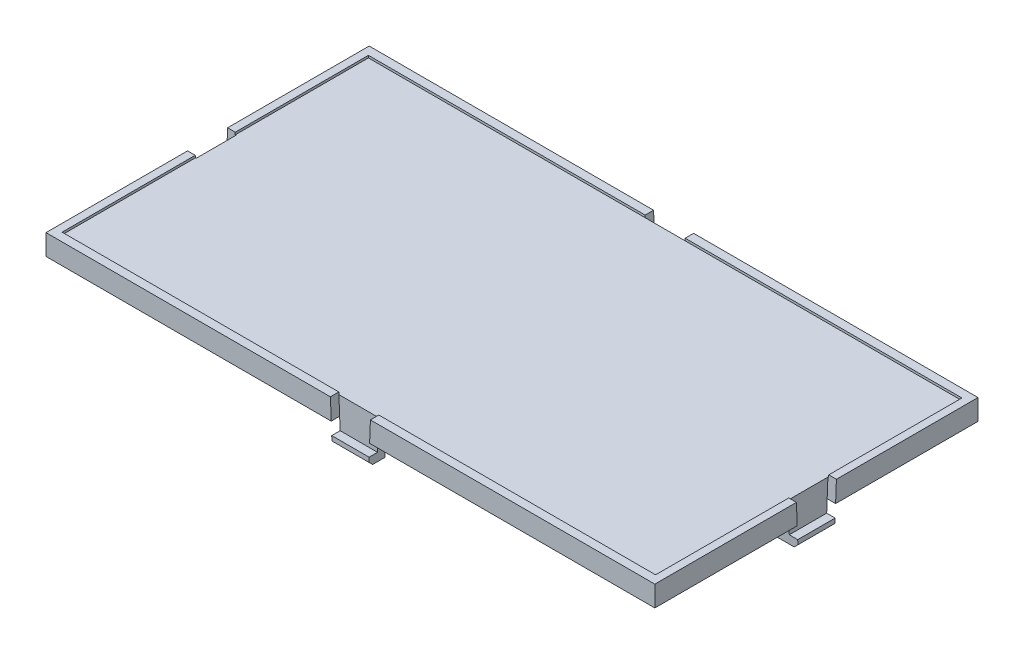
ISO-10303-21;
HEADER;
FILE_DESCRIPTION(('STEP AP214'),'2;1');
FILE_NAME('part.step','',(''),(''),'','','');
FILE_SCHEMA(('AUTOMOTIVE_DESIGN { 1 0 10303 214 1 1 1 1 }'));
ENDSEC;
DATA;
#1=APPLICATION_CONTEXT('core data for automotive mechanical design processes');
#2=APPLICATION_PROTOCOL_DEFINITION('international standard','automotive_design',2000,#1);
#3=PRODUCT_CONTEXT('',#1,'mechanical');
#4=PRODUCT('Part','Part','',(#3));
#5=PRODUCT_RELATED_PRODUCT_CATEGORY('part','',(#4));
#6=PRODUCT_DEFINITION_FORMATION('','',#4);
#7=PRODUCT_DEFINITION_CONTEXT('part definition',#1,'design');
#8=PRODUCT_DEFINITION('design','',#6,#7);
#9=PRODUCT_DEFINITION_SHAPE('','',#8);
#10=(LENGTH_UNIT() NAMED_UNIT(*) SI_UNIT(.MILLI.,.METRE.));
#11=(NAMED_UNIT(*) PLANE_ANGLE_UNIT() SI_UNIT($,.RADIAN.));
#12=(NAMED_UNIT(*) SI_UNIT($,.STERADIAN.) SOLID_ANGLE_UNIT());
#13=UNCERTAINTY_MEASURE_WITH_UNIT(LENGTH_MEASURE(1.E-05),#10,'distance_accuracy_value','');
#14=(GEOMETRIC_REPRESENTATION_CONTEXT(3) GLOBAL_UNCERTAINTY_ASSIGNED_CONTEXT((#13)) GLOBAL_UNIT_ASSIGNED_CONTEXT((#10,
#11,#12)) REPRESENTATION_CONTEXT('',''));
#15=CARTESIAN_POINT('',(0.,0.,0.));
#16=DIRECTION('',(0.,0.,1.));
#17=DIRECTION('',(1.,0.,0.));
#18=AXIS2_PLACEMENT_3D('',#15,#16,#17);
#19=CARTESIAN_POINT('',(39.75,2.7,21.1));
#20=DIRECTION('',(-1.,0.,0.));
#21=DIRECTION('',(0.,0.,1.));
#22=AXIS2_PLACEMENT_3D('',#19,#20,#21);
#23=PLANE('',#22);
#24=DIRECTION('',(0.,0.,1.));
#25=VECTOR('',#24,1.);
#26=CARTESIAN_POINT('',(39.75,-2.20000000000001,-3.));
#27=LINE('',#26,#25);
#28=CARTESIAN_POINT('',(39.75,-2.20000000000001,-2.41960784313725));
#29=VERTEX_POINT('',#28);
#30=CARTESIAN_POINT('',(39.75,-2.20000000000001,2.41960784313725));
#31=VERTEX_POINT('',#30);
#32=EDGE_CURVE('E424',#29,#31,#27,.T.);
#33=ORIENTED_EDGE('',*,*,#32,.F.);
#34=DIRECTION('',(0.,-0.999231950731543,0.0391855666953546));
#35=VECTOR('',#34,1.);
#36=CARTESIAN_POINT('',(39.75,-2.7,-2.4));
#37=LINE('',#36,#35);
#38=CARTESIAN_POINT('',(39.75,-1.6,-2.44313725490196));
#39=VERTEX_POINT('',#38);
#40=EDGE_CURVE('E435',#39,#29,#37,.T.);
#41=ORIENTED_EDGE('',*,*,#40,.F.);
#42=DIRECTION('',(0.,0.,1.));
#43=VECTOR('',#42,1.);
#44=CARTESIAN_POINT('',(39.75,-1.6,-2.44313725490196));
#45=LINE('',#44,#43);
#46=CARTESIAN_POINT('',(39.75,-1.6,2.44313725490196));
#47=VERTEX_POINT('',#46);
#48=EDGE_CURVE('E903',#39,#47,#45,.T.);
#49=ORIENTED_EDGE('',*,*,#48,.T.);
#50=DIRECTION('',(0.,0.999231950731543,0.0391855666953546));
#51=VECTOR('',#50,1.);
#52=CARTESIAN_POINT('',(39.75,2.4,2.6));
#53=LINE('',#52,#51);
#54=EDGE_CURVE('E436',#31,#47,#53,.T.);
#55=ORIENTED_EDGE('',*,*,#54,.F.);
#56=EDGE_LOOP('',(#33,#41,#49,#55));
#57=FACE_BOUND('',#56,.T.);
#58=ADVANCED_FACE('F34',(#57),#23,.F.);
#59=CARTESIAN_POINT('',(37.1,-2.7,-2.4));
#60=DIRECTION('',(0.,0.0391855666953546,0.999231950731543));
#61=DIRECTION('',(0.,-0.999231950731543,0.0391855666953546));
#62=AXIS2_PLACEMENT_3D('',#59,#60,#61);
#63=PLANE('',#62);
#64=DIRECTION('',(0.706835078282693,0.706835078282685,-0.0277190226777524));
#65=VECTOR('',#64,1.);
#66=CARTESIAN_POINT('',(38.1758259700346,-3.77417402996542,-2.35787552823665));
#67=LINE('',#66,#65);
#68=CARTESIAN_POINT('',(39.25,-2.7,-2.4));
#69=VERTEX_POINT('',#68);
#70=EDGE_CURVE('E421',#69,#29,#67,.T.);
#71=ORIENTED_EDGE('',*,*,#70,.F.);
#72=DIRECTION('',(1.,0.,0.));
#73=VECTOR('',#72,1.);
#74=CARTESIAN_POINT('',(37.1,-2.7,-2.4));
#75=LINE('',#74,#73);
#76=CARTESIAN_POINT('',(37.1,-2.7,-2.4));
#77=VERTEX_POINT('',#76);
#78=EDGE_CURVE('E453',#77,#69,#75,.T.);
#79=ORIENTED_EDGE('',*,*,#78,.F.);
#80=DIRECTION('',(0.,-0.999231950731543,0.0391855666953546));
#81=VECTOR('',#80,1.);
#82=CARTESIAN_POINT('',(37.1,-2.7,-2.4));
#83=LINE('',#82,#81);
#84=CARTESIAN_POINT('',(37.1,0.3,-2.51764705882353));
#85=VERTEX_POINT('',#84);
#86=EDGE_CURVE('E445',#85,#77,#83,.T.);
#87=ORIENTED_EDGE('',*,*,#86,.F.);
#88=DIRECTION('',(-1.,0.,0.));
#89=VECTOR('',#88,1.);
#90=CARTESIAN_POINT('',(0.,0.3,-2.51764705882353));
#91=LINE('',#90,#89);
#92=CARTESIAN_POINT('',(37.2,0.3,-2.51764705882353));
#93=VERTEX_POINT('',#92);
#94=EDGE_CURVE('E828',#93,#85,#91,.T.);
#95=ORIENTED_EDGE('',*,*,#94,.F.);
#96=DIRECTION('',(0.,-0.999231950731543,0.0391855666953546));
#97=VECTOR('',#96,1.);
#98=CARTESIAN_POINT('',(37.2,0.945374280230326,-2.54295585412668));
#99=LINE('',#98,#97);
#100=CARTESIAN_POINT('',(37.2,0.,-2.50588235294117));
#101=VERTEX_POINT('',#100);
#102=EDGE_CURVE('E464',#93,#101,#99,.T.);
#103=ORIENTED_EDGE('',*,*,#102,.T.);
#104=DIRECTION('',(1.,0.,0.));
#105=VECTOR('',#104,1.);
#106=CARTESIAN_POINT('',(0.,0.,-2.50588235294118));
#107=LINE('',#106,#105);
#108=CARTESIAN_POINT('',(38.65,0.,-2.50588235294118));
#109=VERTEX_POINT('',#108);
#110=EDGE_CURVE('E468',#101,#109,#107,.T.);
#111=ORIENTED_EDGE('',*,*,#110,.T.);
#112=DIRECTION('',(0.,-0.999231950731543,0.0391855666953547));
#113=VECTOR('',#112,1.);
#114=CARTESIAN_POINT('',(38.65,2.7,-2.61176470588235));
#115=LINE('',#114,#113);
#116=CARTESIAN_POINT('',(38.65,-1.6,-2.44313725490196));
#117=VERTEX_POINT('',#116);
#118=EDGE_CURVE('E905',#109,#117,#115,.T.);
#119=ORIENTED_EDGE('',*,*,#118,.T.);
#120=DIRECTION('',(1.,0.,0.));
#121=VECTOR('',#120,1.);
#122=CARTESIAN_POINT('',(38.65,-1.6,-2.44313725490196));
#123=LINE('',#122,#121);
#124=EDGE_CURVE('E442',#117,#39,#123,.T.);
#125=ORIENTED_EDGE('',*,*,#124,.T.);
#126=ORIENTED_EDGE('',*,*,#40,.T.);
#127=EDGE_LOOP('',(#71,#79,#87,#95,#103,#111,#119,#125,#126));
#128=FACE_BOUND('',#127,.T.);
#129=ADVANCED_FACE('F439',(#128),#63,.F.);
#130=CARTESIAN_POINT('',(37.1,2.4,2.6));
#131=DIRECTION('',(0.,0.0391855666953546,-0.999231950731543));
#132=DIRECTION('',(0.,0.999231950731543,0.0391855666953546));
#133=AXIS2_PLACEMENT_3D('',#130,#131,#132);
#134=PLANE('',#133);
#135=DIRECTION('',(-0.706835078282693,-0.706835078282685,-0.0277190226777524));
#136=VECTOR('',#135,1.);
#137=CARTESIAN_POINT('',(40.727785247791,-1.22221475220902,2.45795236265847));
#138=LINE('',#137,#136);
#139=CARTESIAN_POINT('',(39.25,-2.7,2.4));
#140=VERTEX_POINT('',#139);
#141=EDGE_CURVE('E48',#31,#140,#138,.T.);
#142=ORIENTED_EDGE('',*,*,#141,.F.);
#143=ORIENTED_EDGE('',*,*,#54,.T.);
#144=DIRECTION('',(1.,0.,0.));
#145=VECTOR('',#144,1.);
#146=CARTESIAN_POINT('',(38.65,-1.6,2.44313725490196));
#147=LINE('',#146,#145);
#148=CARTESIAN_POINT('',(38.65,-1.6,2.44313725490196));
#149=VERTEX_POINT('',#148);
#150=EDGE_CURVE('E899',#149,#47,#147,.T.);
#151=ORIENTED_EDGE('',*,*,#150,.F.);
#152=DIRECTION('',(0.,0.999231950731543,0.0391855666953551));
#153=VECTOR('',#152,1.);
#154=CARTESIAN_POINT('',(38.65,-1.6,2.44313725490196));
#155=LINE('',#154,#153);
#156=CARTESIAN_POINT('',(38.65,0.,2.50588235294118));
#157=VERTEX_POINT('',#156);
#158=EDGE_CURVE('E912',#149,#157,#155,.T.);
#159=ORIENTED_EDGE('',*,*,#158,.T.);
#160=DIRECTION('',(-1.,0.,0.));
#161=VECTOR('',#160,1.);
#162=CARTESIAN_POINT('',(0.,0.,2.50588235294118));
#163=LINE('',#162,#161);
#164=CARTESIAN_POINT('',(37.2,0.,2.50588235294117));
#165=VERTEX_POINT('',#164);
#166=EDGE_CURVE('E461',#157,#165,#163,.T.);
#167=ORIENTED_EDGE('',*,*,#166,.T.);
#168=DIRECTION('',(0.,0.999231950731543,0.0391855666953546));
#169=VECTOR('',#168,1.);
#170=CARTESIAN_POINT('',(37.2,-0.542533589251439,2.48460652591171));
#171=LINE('',#170,#169);
#172=CARTESIAN_POINT('',(37.2,0.3,2.51764705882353));
#173=VERTEX_POINT('',#172);
#174=EDGE_CURVE('E455',#165,#173,#171,.T.);
#175=ORIENTED_EDGE('',*,*,#174,.T.);
#176=DIRECTION('',(1.,0.,0.));
#177=VECTOR('',#176,1.);
#178=CARTESIAN_POINT('',(0.,0.3,2.51764705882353));
#179=LINE('',#178,#177);
#180=CARTESIAN_POINT('',(37.1,0.3,2.51764705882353));
#181=VERTEX_POINT('',#180);
#182=EDGE_CURVE('E826',#181,#173,#179,.T.);
#183=ORIENTED_EDGE('',*,*,#182,.F.);
#184=DIRECTION('',(0.,0.999231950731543,0.0391855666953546));
#185=VECTOR('',#184,1.);
#186=CARTESIAN_POINT('',(37.1,2.4,2.6));
#187=LINE('',#186,#185);
#188=CARTESIAN_POINT('',(37.1,-2.7,2.4));
#189=VERTEX_POINT('',#188);
#190=EDGE_CURVE('E887',#189,#181,#187,.T.);
#191=ORIENTED_EDGE('',*,*,#190,.F.);
#192=DIRECTION('',(1.,0.,0.));
#193=VECTOR('',#192,1.);
#194=CARTESIAN_POINT('',(37.1,-2.7,2.4));
#195=LINE('',#194,#193);
#196=EDGE_CURVE('E456',#189,#140,#195,.T.);
#197=ORIENTED_EDGE('',*,*,#196,.T.);
#198=EDGE_LOOP('',(#142,#143,#151,#159,#167,#175,#183,#191,#197));
#199=FACE_BOUND('',#198,.T.);
#200=ADVANCED_FACE('F947',(#199),#134,.F.);
#201=CARTESIAN_POINT('',(37.1,-2.7,-2.4));
#202=DIRECTION('',(0.,1.,0.));
#203=DIRECTION('',(0.,0.,1.));
#204=AXIS2_PLACEMENT_3D('',#201,#202,#203);
#205=PLANE('',#204);
#206=DIRECTION('',(0.,0.,-1.));
#207=VECTOR('',#206,1.);
#208=CARTESIAN_POINT('',(39.25,-2.7,-2.4));
#209=LINE('',#208,#207);
#210=EDGE_CURVE('E11',#140,#69,#209,.T.);
#211=ORIENTED_EDGE('',*,*,#210,.F.);
#212=ORIENTED_EDGE('',*,*,#196,.F.);
#213=DIRECTION('',(0.,0.,1.));
#214=VECTOR('',#213,1.);
#215=CARTESIAN_POINT('',(37.1,-2.7,-2.4));
#216=LINE('',#215,#214);
#217=EDGE_CURVE('E450',#77,#189,#216,.T.);
#218=ORIENTED_EDGE('',*,*,#217,.F.);
#219=ORIENTED_EDGE('',*,*,#78,.T.);
#220=EDGE_LOOP('',(#211,#212,#218,#219));
#221=FACE_BOUND('',#220,.T.);
#222=ADVANCED_FACE('F960',(#221),#205,.F.);
#223=CARTESIAN_POINT('',(0.,2.7,0.));
#224=DIRECTION('',(0.,1.,0.));
#225=DIRECTION('',(0.,0.,1.));
#226=AXIS2_PLACEMENT_3D('',#223,#224,#225);
#227=PLANE('',#226);
#228=DIRECTION('',(0.,0.,-1.));
#229=VECTOR('',#228,1.);
#230=CARTESIAN_POINT('',(38.75,2.7,20.));
#231=LINE('',#230,#229);
#232=CARTESIAN_POINT('',(38.75,2.7,-2.61176470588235));
#233=VERTEX_POINT('',#232);
#234=CARTESIAN_POINT('',(38.75,2.7,-20.));
#235=VERTEX_POINT('',#234);
#236=EDGE_CURVE('E741',#233,#235,#231,.T.);
#237=ORIENTED_EDGE('',*,*,#236,.F.);
#238=DIRECTION('',(1.,0.,0.));
#239=VECTOR('',#238,1.);
#240=CARTESIAN_POINT('',(38.65,2.7,-2.61176470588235));
#241=LINE('',#240,#239);
#242=CARTESIAN_POINT('',(39.75,2.7,-2.61176470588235));
#243=VERTEX_POINT('',#242);
#244=EDGE_CURVE('E893',#233,#243,#241,.T.);
#245=ORIENTED_EDGE('',*,*,#244,.T.);
#246=DIRECTION('',(0.,0.,-1.));
#247=VECTOR('',#246,1.);
#248=CARTESIAN_POINT('',(39.75,2.7,21.1));
#249=LINE('',#248,#247);
#250=CARTESIAN_POINT('',(39.75,2.7,-21.1));
#251=VERTEX_POINT('',#250);
#252=EDGE_CURVE('E769',#243,#251,#249,.T.);
#253=ORIENTED_EDGE('',*,*,#252,.T.);
#254=DIRECTION('',(-1.,0.,0.));
#255=VECTOR('',#254,1.);
#256=CARTESIAN_POINT('',(39.75,2.7,-21.1));
#257=LINE('',#256,#255);
#258=CARTESIAN_POINT('',(2.61176470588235,2.7,-21.1));
#259=VERTEX_POINT('',#258);
#260=EDGE_CURVE('E774',#251,#259,#257,.T.);
#261=ORIENTED_EDGE('',*,*,#260,.T.);
#262=DIRECTION('',(0.,0.,-1.));
#263=VECTOR('',#262,1.);
#264=CARTESIAN_POINT('',(2.61176470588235,2.7,-20.));
#265=LINE('',#264,#263);
#266=CARTESIAN_POINT('',(2.61176470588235,2.7,-20.));
#267=VERTEX_POINT('',#266);
#268=EDGE_CURVE('E504',#267,#259,#265,.T.);
#269=ORIENTED_EDGE('',*,*,#268,.F.);
#270=DIRECTION('',(-1.,0.,0.));
#271=VECTOR('',#270,1.);
#272=CARTESIAN_POINT('',(38.75,2.7,-20.));
#273=LINE('',#272,#271);
#274=EDGE_CURVE('E746',#235,#267,#273,.T.);
#275=ORIENTED_EDGE('',*,*,#274,.F.);
#276=EDGE_LOOP('',(#237,#245,#253,#261,#269,#275));
#277=FACE_BOUND('',#276,.T.);
#278=ADVANCED_FACE('F986',(#277),#227,.T.);
#279=CARTESIAN_POINT('',(39.75,2.7,21.1));
#280=VERTEX_POINT('',#279);
#281=CARTESIAN_POINT('',(39.75,2.7,2.61176470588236));
#282=VERTEX_POINT('',#281);
#283=EDGE_CURVE('E770',#280,#282,#249,.T.);
#284=ORIENTED_EDGE('',*,*,#283,.T.);
#285=DIRECTION('',(1.,0.,0.));
#286=VECTOR('',#285,1.);
#287=CARTESIAN_POINT('',(38.65,2.7,2.61176470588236));
#288=LINE('',#287,#286);
#289=CARTESIAN_POINT('',(38.75,2.7,2.61176470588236));
#290=VERTEX_POINT('',#289);
#291=EDGE_CURVE('E896',#290,#282,#288,.T.);
#292=ORIENTED_EDGE('',*,*,#291,.F.);
#293=CARTESIAN_POINT('',(38.75,2.7,20.));
#294=VERTEX_POINT('',#293);
#295=EDGE_CURVE('E742',#294,#290,#231,.T.);
#296=ORIENTED_EDGE('',*,*,#295,.F.);
#297=DIRECTION('',(1.,0.,0.));
#298=VECTOR('',#297,1.);
#299=CARTESIAN_POINT('',(38.75,2.7,20.));
#300=LINE('',#299,#298);
#301=CARTESIAN_POINT('',(2.61176470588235,2.7,20.));
#302=VERTEX_POINT('',#301);
#303=EDGE_CURVE('E737',#302,#294,#300,.T.);
#304=ORIENTED_EDGE('',*,*,#303,.F.);
#305=DIRECTION('',(0.,0.,1.));
#306=VECTOR('',#305,1.);
#307=CARTESIAN_POINT('',(2.61176470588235,2.7,20.));
#308=LINE('',#307,#306);
#309=CARTESIAN_POINT('',(2.61176470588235,2.7,21.1));
#310=VERTEX_POINT('',#309);
#311=EDGE_CURVE('E570',#302,#310,#308,.T.);
#312=ORIENTED_EDGE('',*,*,#311,.T.);
#313=DIRECTION('',(1.,0.,0.));
#314=VECTOR('',#313,1.);
#315=CARTESIAN_POINT('',(39.75,2.7,21.1));
#316=LINE('',#315,#314);
#317=EDGE_CURVE('E764',#310,#280,#316,.T.);
#318=ORIENTED_EDGE('',*,*,#317,.T.);
#319=EDGE_LOOP('',(#284,#292,#296,#304,#312,#318));
#320=FACE_BOUND('',#319,.T.);
#321=ADVANCED_FACE('F931',(#320),#227,.T.);
#322=DIRECTION('',(0.,-0.999231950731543,0.0391855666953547));
#323=VECTOR('',#322,1.);
#324=CARTESIAN_POINT('',(39.75,2.7,-2.61176470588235));
#325=LINE('',#324,#323);
#326=CARTESIAN_POINT('',(39.75,0.,-2.50588235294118));
#327=VERTEX_POINT('',#326);
#328=EDGE_CURVE('E429',#243,#327,#325,.T.);
#329=ORIENTED_EDGE('',*,*,#328,.T.);
#330=DIRECTION('',(0.,0.,-1.));
#331=VECTOR('',#330,1.);
#332=CARTESIAN_POINT('',(39.75,0.,21.1));
#333=LINE('',#332,#331);
#334=CARTESIAN_POINT('',(39.75,0.,-21.1));
#335=VERTEX_POINT('',#334);
#336=EDGE_CURVE('E785',#327,#335,#333,.T.);
#337=ORIENTED_EDGE('',*,*,#336,.T.);
#338=DIRECTION('',(0.,-1.,0.));
#339=VECTOR('',#338,1.);
#340=CARTESIAN_POINT('',(39.75,2.7,-21.1));
#341=LINE('',#340,#339);
#342=EDGE_CURVE('E795',#251,#335,#341,.T.);
#343=ORIENTED_EDGE('',*,*,#342,.F.);
#344=ORIENTED_EDGE('',*,*,#252,.F.);
#345=EDGE_LOOP('',(#329,#337,#343,#344));
#346=FACE_BOUND('',#345,.T.);
#347=ADVANCED_FACE('F974',(#346),#23,.F.);
#348=DIRECTION('',(0.,0.999231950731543,0.0391855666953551));
#349=VECTOR('',#348,1.);
#350=CARTESIAN_POINT('',(39.75,-1.6,2.44313725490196));
#351=LINE('',#350,#349);
#352=CARTESIAN_POINT('',(39.75,0.,2.50588235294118));
#353=VERTEX_POINT('',#352);
#354=EDGE_CURVE('E906',#353,#282,#351,.T.);
#355=ORIENTED_EDGE('',*,*,#354,.T.);
#356=ORIENTED_EDGE('',*,*,#283,.F.);
#357=DIRECTION('',(0.,-1.,0.));
#358=VECTOR('',#357,1.);
#359=CARTESIAN_POINT('',(39.75,2.7,21.1));
#360=LINE('',#359,#358);
#361=CARTESIAN_POINT('',(39.75,0.,21.1));
#362=VERTEX_POINT('',#361);
#363=EDGE_CURVE('E798',#280,#362,#360,.T.);
#364=ORIENTED_EDGE('',*,*,#363,.T.);
#365=EDGE_CURVE('E786',#362,#353,#333,.T.);
#366=ORIENTED_EDGE('',*,*,#365,.T.);
#367=EDGE_LOOP('',(#355,#356,#364,#366));
#368=FACE_BOUND('',#367,.T.);
#369=ADVANCED_FACE('F937',(#368),#23,.F.);
#370=CARTESIAN_POINT('',(38.75,2.4,20.));
#371=DIRECTION('',(1.,0.,0.));
#372=DIRECTION('',(0.,0.,-1.));
#373=AXIS2_PLACEMENT_3D('',#370,#371,#372);
#374=PLANE('',#373);
#375=DIRECTION('',(0.,-0.999231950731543,0.0391855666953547));
#376=VECTOR('',#375,1.);
#377=CARTESIAN_POINT('',(38.75,1.51508637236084,-2.56529750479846));
#378=LINE('',#377,#376);
#379=CARTESIAN_POINT('',(38.75,2.4,-2.6));
#380=VERTEX_POINT('',#379);
#381=EDGE_CURVE('E443',#233,#380,#378,.T.);
#382=ORIENTED_EDGE('',*,*,#381,.F.);
#383=ORIENTED_EDGE('',*,*,#236,.T.);
#384=DIRECTION('',(0.,1.,0.));
#385=VECTOR('',#384,1.);
#386=CARTESIAN_POINT('',(38.75,2.4,-20.));
#387=LINE('',#386,#385);
#388=CARTESIAN_POINT('',(38.75,2.4,-20.));
#389=VERTEX_POINT('',#388);
#390=EDGE_CURVE('E753',#389,#235,#387,.T.);
#391=ORIENTED_EDGE('',*,*,#390,.F.);
#392=DIRECTION('',(0.,0.,-1.));
#393=VECTOR('',#392,1.);
#394=CARTESIAN_POINT('',(38.75,2.4,20.));
#395=LINE('',#394,#393);
#396=EDGE_CURVE('E725',#380,#389,#395,.T.);
#397=ORIENTED_EDGE('',*,*,#396,.F.);
#398=EDGE_LOOP('',(#382,#383,#391,#397));
#399=FACE_BOUND('',#398,.T.);
#400=ADVANCED_FACE('F844',(#399),#374,.F.);
#401=DIRECTION('',(0.,0.999231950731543,0.0391855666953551));
#402=VECTOR('',#401,1.);
#403=CARTESIAN_POINT('',(38.75,3.08130518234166,2.62671785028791));
#404=LINE('',#403,#402);
#405=CARTESIAN_POINT('',(38.75,2.4,2.6));
#406=VERTEX_POINT('',#405);
#407=EDGE_CURVE('E447',#406,#290,#404,.T.);
#408=ORIENTED_EDGE('',*,*,#407,.F.);
#409=CARTESIAN_POINT('',(38.75,2.4,20.));
#410=VERTEX_POINT('',#409);
#411=EDGE_CURVE('E726',#410,#406,#395,.T.);
#412=ORIENTED_EDGE('',*,*,#411,.F.);
#413=DIRECTION('',(0.,1.,0.));
#414=VECTOR('',#413,1.);
#415=CARTESIAN_POINT('',(38.75,2.4,20.));
#416=LINE('',#415,#414);
#417=EDGE_CURVE('E756',#410,#294,#416,.T.);
#418=ORIENTED_EDGE('',*,*,#417,.T.);
#419=ORIENTED_EDGE('',*,*,#295,.T.);
#420=EDGE_LOOP('',(#408,#412,#418,#419));
#421=FACE_BOUND('',#420,.T.);
#422=ADVANCED_FACE('F927',(#421),#374,.F.);
#423=CARTESIAN_POINT('',(0.,2.4,0.));
#424=DIRECTION('',(0.,1.,0.));
#425=DIRECTION('',(0.,0.,1.));
#426=AXIS2_PLACEMENT_3D('',#423,#424,#425);
#427=PLANE('',#426);
#428=DIRECTION('',(0.,0.,-1.));
#429=VECTOR('',#428,1.);
#430=CARTESIAN_POINT('',(38.65,2.4,0.));
#431=LINE('',#430,#429);
#432=CARTESIAN_POINT('',(38.65,2.4,2.6));
#433=VERTEX_POINT('',#432);
#434=CARTESIAN_POINT('',(38.65,2.4,-2.6));
#435=VERTEX_POINT('',#434);
#436=EDGE_CURVE('E838',#433,#435,#431,.T.);
#437=ORIENTED_EDGE('',*,*,#436,.T.);
#438=DIRECTION('',(1.,0.,0.));
#439=VECTOR('',#438,1.);
#440=CARTESIAN_POINT('',(0.,2.4,-2.6));
#441=LINE('',#440,#439);
#442=EDGE_CURVE('E42',#435,#380,#441,.T.);
#443=ORIENTED_EDGE('',*,*,#442,.T.);
#444=ORIENTED_EDGE('',*,*,#396,.T.);
#445=DIRECTION('',(-1.,0.,0.));
#446=VECTOR('',#445,1.);
#447=CARTESIAN_POINT('',(38.75,2.4,-20.));
#448=LINE('',#447,#446);
#449=CARTESIAN_POINT('',(2.6,2.4,-20.));
#450=VERTEX_POINT('',#449);
#451=EDGE_CURVE('E730',#389,#450,#448,.T.);
#452=ORIENTED_EDGE('',*,*,#451,.T.);
#453=DIRECTION('',(1.,0.,0.));
#454=VECTOR('',#453,1.);
#455=CARTESIAN_POINT('',(0.,2.4,-20.));
#456=LINE('',#455,#454);
#457=CARTESIAN_POINT('',(-2.6,2.4,-20.));
#458=VERTEX_POINT('',#457);
#459=EDGE_CURVE('E503',#458,#450,#456,.T.);
#460=ORIENTED_EDGE('',*,*,#459,.F.);
#461=CARTESIAN_POINT('',(-38.75,2.4,-20.));
#462=VERTEX_POINT('',#461);
#463=EDGE_CURVE('E729',#458,#462,#448,.T.);
#464=ORIENTED_EDGE('',*,*,#463,.T.);
#465=DIRECTION('',(0.,0.,1.));
#466=VECTOR('',#465,1.);
#467=CARTESIAN_POINT('',(-38.75,2.4,20.));
#468=LINE('',#467,#466);
#469=CARTESIAN_POINT('',(-38.75,2.4,-2.6));
#470=VERTEX_POINT('',#469);
#471=EDGE_CURVE('E717',#462,#470,#468,.T.);
#472=ORIENTED_EDGE('',*,*,#471,.T.);
#473=DIRECTION('',(-1.,0.,0.));
#474=VECTOR('',#473,1.);
#475=CARTESIAN_POINT('',(0.,2.4,-2.6));
#476=LINE('',#475,#474);
#477=CARTESIAN_POINT('',(-38.65,2.4,-2.6));
#478=VERTEX_POINT('',#477);
#479=EDGE_CURVE('E815',#478,#470,#476,.T.);
#480=ORIENTED_EDGE('',*,*,#479,.F.);
#481=DIRECTION('',(0.,0.,1.));
#482=VECTOR('',#481,1.);
#483=CARTESIAN_POINT('',(-38.65,2.4,0.));
#484=LINE('',#483,#482);
#485=CARTESIAN_POINT('',(-38.65,2.4,2.6));
#486=VERTEX_POINT('',#485);
#487=EDGE_CURVE('E629',#478,#486,#484,.T.);
#488=ORIENTED_EDGE('',*,*,#487,.T.);
#489=DIRECTION('',(1.,0.,0.));
#490=VECTOR('',#489,1.);
#491=CARTESIAN_POINT('',(0.,2.4,2.6));
#492=LINE('',#491,#490);
#493=CARTESIAN_POINT('',(-38.75,2.4,2.6));
#494=VERTEX_POINT('',#493);
#495=EDGE_CURVE('E813',#494,#486,#492,.T.);
#496=ORIENTED_EDGE('',*,*,#495,.F.);
#497=CARTESIAN_POINT('',(-38.75,2.4,20.));
#498=VERTEX_POINT('',#497);
#499=EDGE_CURVE('E721',#494,#498,#468,.T.);
#500=ORIENTED_EDGE('',*,*,#499,.T.);
#501=DIRECTION('',(1.,0.,0.));
#502=VECTOR('',#501,1.);
#503=CARTESIAN_POINT('',(38.75,2.4,20.));
#504=LINE('',#503,#502);
#505=CARTESIAN_POINT('',(-2.6,2.4,20.));
#506=VERTEX_POINT('',#505);
#507=EDGE_CURVE('E722',#498,#506,#504,.T.);
#508=ORIENTED_EDGE('',*,*,#507,.T.);
#509=DIRECTION('',(-1.,0.,0.));
#510=VECTOR('',#509,1.);
#511=CARTESIAN_POINT('',(0.,2.4,20.));
#512=LINE('',#511,#510);
#513=CARTESIAN_POINT('',(2.6,2.4,20.));
#514=VERTEX_POINT('',#513);
#515=EDGE_CURVE('E567',#514,#506,#512,.T.);
#516=ORIENTED_EDGE('',*,*,#515,.F.);
#517=EDGE_CURVE('E720',#514,#410,#504,.T.);
#518=ORIENTED_EDGE('',*,*,#517,.T.);
#519=ORIENTED_EDGE('',*,*,#411,.T.);
#520=DIRECTION('',(-1.,0.,0.));
#521=VECTOR('',#520,1.);
#522=CARTESIAN_POINT('',(0.,2.4,2.6));
#523=LINE('',#522,#521);
#524=EDGE_CURVE('E830',#406,#433,#523,.T.);
#525=ORIENTED_EDGE('',*,*,#524,.T.);
#526=EDGE_LOOP('',(#437,#443,#444,#452,#460,#464,#472,#480,#488,#496,#500,#508,#516,#518,#519,#525));
#527=FACE_BOUND('',#526,.T.);
#528=ADVANCED_FACE('F836',(#527),#427,.T.);
#529=CARTESIAN_POINT('',(0.,0.,0.));
#530=DIRECTION('',(0.,1.,0.));
#531=DIRECTION('',(0.,0.,1.));
#532=AXIS2_PLACEMENT_3D('',#529,#530,#531);
#533=PLANE('',#532);
#534=ORIENTED_EDGE('',*,*,#110,.F.);
#535=DIRECTION('',(0.,0.,1.));
#536=VECTOR('',#535,1.);
#537=CARTESIAN_POINT('',(37.2,0.,-19.));
#538=LINE('',#537,#536);
#539=CARTESIAN_POINT('',(37.2,0.,-19.));
#540=VERTEX_POINT('',#539);
#541=EDGE_CURVE('E698',#540,#101,#538,.T.);
#542=ORIENTED_EDGE('',*,*,#541,.F.);
#543=DIRECTION('',(1.,0.,0.));
#544=VECTOR('',#543,1.);
#545=CARTESIAN_POINT('',(37.2,0.,-19.));
#546=LINE('',#545,#544);
#547=CARTESIAN_POINT('',(2.50588235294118,0.,-19.));
#548=VERTEX_POINT('',#547);
#549=EDGE_CURVE('E693',#548,#540,#546,.T.);
#550=ORIENTED_EDGE('',*,*,#549,.F.);
#551=DIRECTION('',(0.,0.,1.));
#552=VECTOR('',#551,1.);
#553=CARTESIAN_POINT('',(2.50588235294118,0.,0.));
#554=LINE('',#553,#552);
#555=CARTESIAN_POINT('',(2.50588235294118,0.,-20.));
#556=VERTEX_POINT('',#555);
#557=EDGE_CURVE('E528',#556,#548,#554,.T.);
#558=ORIENTED_EDGE('',*,*,#557,.F.);
#559=CARTESIAN_POINT('',(2.50588235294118,0.,-21.1));
#560=VERTEX_POINT('',#559);
#561=EDGE_CURVE('E531',#560,#556,#554,.T.);
#562=ORIENTED_EDGE('',*,*,#561,.F.);
#563=DIRECTION('',(-1.,0.,0.));
#564=VECTOR('',#563,1.);
#565=CARTESIAN_POINT('',(39.75,0.,-21.1));
#566=LINE('',#565,#564);
#567=EDGE_CURVE('E790',#335,#560,#566,.T.);
#568=ORIENTED_EDGE('',*,*,#567,.F.);
#569=ORIENTED_EDGE('',*,*,#336,.F.);
#570=EDGE_CURVE('E467',#109,#327,#107,.T.);
#571=ORIENTED_EDGE('',*,*,#570,.F.);
#572=EDGE_LOOP('',(#534,#542,#550,#558,#562,#568,#569,#571));
#573=FACE_BOUND('',#572,.T.);
#574=ADVANCED_FACE('F872',(#573),#533,.F.);
#575=EDGE_CURVE('E462',#353,#157,#163,.T.);
#576=ORIENTED_EDGE('',*,*,#575,.F.);
#577=ORIENTED_EDGE('',*,*,#365,.F.);
#578=DIRECTION('',(1.,0.,0.));
#579=VECTOR('',#578,1.);
#580=CARTESIAN_POINT('',(39.75,0.,21.1));
#581=LINE('',#580,#579);
#582=CARTESIAN_POINT('',(2.50588235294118,0.,21.1));
#583=VERTEX_POINT('',#582);
#584=EDGE_CURVE('E781',#583,#362,#581,.T.);
#585=ORIENTED_EDGE('',*,*,#584,.F.);
#586=DIRECTION('',(0.,0.,-1.));
#587=VECTOR('',#586,1.);
#588=CARTESIAN_POINT('',(2.50588235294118,0.,0.));
#589=LINE('',#588,#587);
#590=CARTESIAN_POINT('',(2.50588235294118,0.,20.));
#591=VERTEX_POINT('',#590);
#592=EDGE_CURVE('E596',#583,#591,#589,.T.);
#593=ORIENTED_EDGE('',*,*,#592,.T.);
#594=CARTESIAN_POINT('',(2.50588235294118,0.,19.));
#595=VERTEX_POINT('',#594);
#596=EDGE_CURVE('E593',#591,#595,#589,.T.);
#597=ORIENTED_EDGE('',*,*,#596,.T.);
#598=DIRECTION('',(-1.,0.,0.));
#599=VECTOR('',#598,1.);
#600=CARTESIAN_POINT('',(37.2,0.,19.));
#601=LINE('',#600,#599);
#602=CARTESIAN_POINT('',(37.2,0.,19.));
#603=VERTEX_POINT('',#602);
#604=EDGE_CURVE('E702',#603,#595,#601,.T.);
#605=ORIENTED_EDGE('',*,*,#604,.F.);
#606=EDGE_CURVE('E697',#165,#603,#538,.T.);
#607=ORIENTED_EDGE('',*,*,#606,.F.);
#608=ORIENTED_EDGE('',*,*,#166,.F.);
#609=EDGE_LOOP('',(#576,#577,#585,#593,#597,#605,#607,#608));
#610=FACE_BOUND('',#609,.T.);
#611=ADVANCED_FACE('F941',(#610),#533,.F.);
#612=CARTESIAN_POINT('',(37.2,0.3,-19.));
#613=DIRECTION('',(1.,0.,0.));
#614=DIRECTION('',(0.,0.,-1.));
#615=AXIS2_PLACEMENT_3D('',#612,#613,#614);
#616=PLANE('',#615);
#617=ORIENTED_EDGE('',*,*,#102,.F.);
#618=DIRECTION('',(0.,0.,1.));
#619=VECTOR('',#618,1.);
#620=CARTESIAN_POINT('',(37.2,0.3,-19.));
#621=LINE('',#620,#619);
#622=CARTESIAN_POINT('',(37.2,0.3,-19.));
#623=VERTEX_POINT('',#622);
#624=EDGE_CURVE('E684',#623,#93,#621,.T.);
#625=ORIENTED_EDGE('',*,*,#624,.F.);
#626=DIRECTION('',(0.,-1.,0.));
#627=VECTOR('',#626,1.);
#628=CARTESIAN_POINT('',(37.2,0.3,-19.));
#629=LINE('',#628,#627);
#630=EDGE_CURVE('E712',#623,#540,#629,.T.);
#631=ORIENTED_EDGE('',*,*,#630,.T.);
#632=ORIENTED_EDGE('',*,*,#541,.T.);
#633=EDGE_LOOP('',(#617,#625,#631,#632));
#634=FACE_BOUND('',#633,.T.);
#635=ADVANCED_FACE('F880',(#634),#616,.F.);
#636=ORIENTED_EDGE('',*,*,#174,.F.);
#637=ORIENTED_EDGE('',*,*,#606,.T.);
#638=DIRECTION('',(0.,-1.,0.));
#639=VECTOR('',#638,1.);
#640=CARTESIAN_POINT('',(37.2,0.3,19.));
#641=LINE('',#640,#639);
#642=CARTESIAN_POINT('',(37.2,0.3,19.));
#643=VERTEX_POINT('',#642);
#644=EDGE_CURVE('E709',#643,#603,#641,.T.);
#645=ORIENTED_EDGE('',*,*,#644,.F.);
#646=EDGE_CURVE('E683',#173,#643,#621,.T.);
#647=ORIENTED_EDGE('',*,*,#646,.F.);
#648=EDGE_LOOP('',(#636,#637,#645,#647));
#649=FACE_BOUND('',#648,.T.);
#650=ADVANCED_FACE('F952',(#649),#616,.F.);
#651=CARTESIAN_POINT('',(0.,0.3,0.));
#652=DIRECTION('',(0.,-1.,0.));
#653=DIRECTION('',(0.,0.,-1.));
#654=AXIS2_PLACEMENT_3D('',#651,#652,#653);
#655=PLANE('',#654);
#656=ORIENTED_EDGE('',*,*,#624,.T.);
#657=ORIENTED_EDGE('',*,*,#94,.T.);
#658=DIRECTION('',(0.,0.,-1.));
#659=VECTOR('',#658,1.);
#660=CARTESIAN_POINT('',(37.1,0.3,0.));
#661=LINE('',#660,#659);
#662=EDGE_CURVE('E823',#181,#85,#661,.T.);
#663=ORIENTED_EDGE('',*,*,#662,.F.);
#664=ORIENTED_EDGE('',*,*,#182,.T.);
#665=ORIENTED_EDGE('',*,*,#646,.T.);
#666=DIRECTION('',(-1.,0.,0.));
#667=VECTOR('',#666,1.);
#668=CARTESIAN_POINT('',(37.2,0.3,19.));
#669=LINE('',#668,#667);
#670=CARTESIAN_POINT('',(-37.2,0.3,19.));
#671=VERTEX_POINT('',#670);
#672=EDGE_CURVE('E687',#643,#671,#669,.T.);
#673=ORIENTED_EDGE('',*,*,#672,.T.);
#674=DIRECTION('',(0.,0.,-1.));
#675=VECTOR('',#674,1.);
#676=CARTESIAN_POINT('',(-37.2,0.3,-19.));
#677=LINE('',#676,#675);
#678=CARTESIAN_POINT('',(-37.2,0.3,2.51764705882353));
#679=VERTEX_POINT('',#678);
#680=EDGE_CURVE('E677',#671,#679,#677,.T.);
#681=ORIENTED_EDGE('',*,*,#680,.T.);
#682=DIRECTION('',(-1.,0.,0.));
#683=VECTOR('',#682,1.);
#684=CARTESIAN_POINT('',(0.,0.3,2.51764705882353));
#685=LINE('',#684,#683);
#686=CARTESIAN_POINT('',(-37.1,0.3,2.51764705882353));
#687=VERTEX_POINT('',#686);
#688=EDGE_CURVE('E807',#687,#679,#685,.T.);
#689=ORIENTED_EDGE('',*,*,#688,.F.);
#690=DIRECTION('',(0.,0.,1.));
#691=VECTOR('',#690,1.);
#692=CARTESIAN_POINT('',(-37.1,0.3,0.));
#693=LINE('',#692,#691);
#694=CARTESIAN_POINT('',(-37.1,0.3,-2.51764705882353));
#695=VERTEX_POINT('',#694);
#696=EDGE_CURVE('E804',#695,#687,#693,.T.);
#697=ORIENTED_EDGE('',*,*,#696,.F.);
#698=DIRECTION('',(1.,0.,0.));
#699=VECTOR('',#698,1.);
#700=CARTESIAN_POINT('',(0.,0.3,-2.51764705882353));
#701=LINE('',#700,#699);
#702=CARTESIAN_POINT('',(-37.2,0.3,-2.51764705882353));
#703=VERTEX_POINT('',#702);
#704=EDGE_CURVE('E810',#703,#695,#701,.T.);
#705=ORIENTED_EDGE('',*,*,#704,.F.);
#706=CARTESIAN_POINT('',(-37.2,0.3,-19.));
#707=VERTEX_POINT('',#706);
#708=EDGE_CURVE('E681',#703,#707,#677,.T.);
#709=ORIENTED_EDGE('',*,*,#708,.T.);
#710=DIRECTION('',(1.,0.,0.));
#711=VECTOR('',#710,1.);
#712=CARTESIAN_POINT('',(37.2,0.3,-19.));
#713=LINE('',#712,#711);
#714=EDGE_CURVE('E680',#707,#623,#713,.T.);
#715=ORIENTED_EDGE('',*,*,#714,.T.);
#716=EDGE_LOOP('',(#656,#657,#663,#664,#665,#673,#681,#689,#697,#705,#709,#715));
#717=FACE_BOUND('',#716,.T.);
#718=ADVANCED_FACE('F883',(#717),#655,.T.);
#719=CARTESIAN_POINT('',(39.75,2.7,-21.1));
#720=DIRECTION('',(0.,0.,1.));
#721=DIRECTION('',(1.,0.,0.));
#722=AXIS2_PLACEMENT_3D('',#719,#720,#721);
#723=PLANE('',#722);
#724=DIRECTION('',(1.,0.,0.));
#725=VECTOR('',#724,1.);
#726=CARTESIAN_POINT('',(-3.,-2.19999999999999,-21.1));
#727=LINE('',#726,#725);
#728=CARTESIAN_POINT('',(-2.41960784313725,-2.19999999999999,-21.1));
#729=VERTEX_POINT('',#728);
#730=CARTESIAN_POINT('',(2.41960784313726,-2.19999999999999,-21.1));
#731=VERTEX_POINT('',#730);
#732=EDGE_CURVE('E471',#729,#731,#727,.T.);
#733=ORIENTED_EDGE('',*,*,#732,.F.);
#734=DIRECTION('',(0.0391855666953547,-0.999231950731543,0.));
#735=VECTOR('',#734,1.);
#736=CARTESIAN_POINT('',(-2.4,-2.69999999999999,-21.1));
#737=LINE('',#736,#735);
#738=CARTESIAN_POINT('',(-2.44313725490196,-1.59999999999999,-21.1));
#739=VERTEX_POINT('',#738);
#740=EDGE_CURVE('E512',#739,#729,#737,.T.);
#741=ORIENTED_EDGE('',*,*,#740,.F.);
#742=DIRECTION('',(1.,0.,0.));
#743=VECTOR('',#742,1.);
#744=CARTESIAN_POINT('',(2.44313725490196,-1.59999999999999,-21.1));
#745=LINE('',#744,#743);
#746=CARTESIAN_POINT('',(2.44313725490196,-1.59999999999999,-21.1));
#747=VERTEX_POINT('',#746);
#748=EDGE_CURVE('E477',#739,#747,#745,.T.);
#749=ORIENTED_EDGE('',*,*,#748,.T.);
#750=DIRECTION('',(0.0391855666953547,0.999231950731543,0.));
#751=VECTOR('',#750,1.);
#752=CARTESIAN_POINT('',(2.6,2.4,-21.1));
#753=LINE('',#752,#751);
#754=EDGE_CURVE('E516',#731,#747,#753,.T.);
#755=ORIENTED_EDGE('',*,*,#754,.F.);
#756=EDGE_LOOP('',(#733,#741,#749,#755));
#757=FACE_BOUND('',#756,.T.);
#758=ADVANCED_FACE('F1036',(#757),#723,.F.);
#759=CARTESIAN_POINT('',(-2.4,-2.69999999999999,-19.));
#760=DIRECTION('',(0.999231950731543,0.0391855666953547,0.));
#761=DIRECTION('',(-0.0391855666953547,0.999231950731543,0.));
#762=AXIS2_PLACEMENT_3D('',#759,#760,#761);
#763=PLANE('',#762);
#764=DIRECTION('',(-0.0277190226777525,0.706835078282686,-0.706835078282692));
#765=VECTOR('',#764,1.);
#766=CARTESIAN_POINT('',(-2.36865155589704,-3.49938532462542,-19.8006146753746));
#767=LINE('',#766,#765);
#768=CARTESIAN_POINT('',(-2.4,-2.69999999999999,-20.6));
#769=VERTEX_POINT('',#768);
#770=EDGE_CURVE('E475',#769,#729,#767,.T.);
#771=ORIENTED_EDGE('',*,*,#770,.F.);
#772=DIRECTION('',(0.,0.,-1.));
#773=VECTOR('',#772,1.);
#774=CARTESIAN_POINT('',(-2.4,-2.69999999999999,-19.));
#775=LINE('',#774,#773);
#776=CARTESIAN_POINT('',(-2.4,-2.69999999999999,-19.));
#777=VERTEX_POINT('',#776);
#778=EDGE_CURVE('E525',#777,#769,#775,.T.);
#779=ORIENTED_EDGE('',*,*,#778,.F.);
#780=DIRECTION('',(0.0391855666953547,-0.999231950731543,0.));
#781=VECTOR('',#780,1.);
#782=CARTESIAN_POINT('',(-2.4,-2.69999999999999,-19.));
#783=LINE('',#782,#781);
#784=CARTESIAN_POINT('',(-2.50588235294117,0.,-19.));
#785=VERTEX_POINT('',#784);
#786=EDGE_CURVE('E513',#785,#777,#783,.T.);
#787=ORIENTED_EDGE('',*,*,#786,.F.);
#788=DIRECTION('',(0.,0.,-1.));
#789=VECTOR('',#788,1.);
#790=CARTESIAN_POINT('',(-2.50588235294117,0.,0.));
#791=LINE('',#790,#789);
#792=CARTESIAN_POINT('',(-2.50588235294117,0.,-20.));
#793=VERTEX_POINT('',#792);
#794=EDGE_CURVE('E535',#785,#793,#791,.T.);
#795=ORIENTED_EDGE('',*,*,#794,.T.);
#796=DIRECTION('',(0.0391855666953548,-0.999231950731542,0.));
#797=VECTOR('',#796,1.);
#798=CARTESIAN_POINT('',(-2.44313725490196,-1.59999999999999,-20.));
#799=LINE('',#798,#797);
#800=CARTESIAN_POINT('',(-2.44313725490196,-1.59999999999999,-20.));
#801=VERTEX_POINT('',#800);
#802=EDGE_CURVE('E481',#793,#801,#799,.T.);
#803=ORIENTED_EDGE('',*,*,#802,.T.);
#804=DIRECTION('',(0.,0.,-1.));
#805=VECTOR('',#804,1.);
#806=CARTESIAN_POINT('',(-2.44313725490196,-1.59999999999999,-20.));
#807=LINE('',#806,#805);
#808=EDGE_CURVE('E491',#801,#739,#807,.T.);
#809=ORIENTED_EDGE('',*,*,#808,.T.);
#810=ORIENTED_EDGE('',*,*,#740,.T.);
#811=EDGE_LOOP('',(#771,#779,#787,#795,#803,#809,#810));
#812=FACE_BOUND('',#811,.T.);
#813=ADVANCED_FACE('F1033',(#812),#763,.F.);
#814=CARTESIAN_POINT('',(2.6,2.4,-19.));
#815=DIRECTION('',(-0.999231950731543,0.0391855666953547,0.));
#816=DIRECTION('',(-0.0391855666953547,-0.999231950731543,0.));
#817=AXIS2_PLACEMENT_3D('',#814,#815,#816);
#818=PLANE('',#817);
#819=DIRECTION('',(-0.0277190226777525,-0.706835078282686,0.706835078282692));
#820=VECTOR('',#819,1.);
#821=CARTESIAN_POINT('',(2.46872839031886,-0.947426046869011,-22.352573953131));
#822=LINE('',#821,#820);
#823=CARTESIAN_POINT('',(2.4,-2.69999999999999,-20.6));
#824=VERTEX_POINT('',#823);
#825=EDGE_CURVE('E473',#731,#824,#822,.T.);
#826=ORIENTED_EDGE('',*,*,#825,.F.);
#827=ORIENTED_EDGE('',*,*,#754,.T.);
#828=DIRECTION('',(0.,0.,-1.));
#829=VECTOR('',#828,1.);
#830=CARTESIAN_POINT('',(2.44313725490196,-1.59999999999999,-20.));
#831=LINE('',#830,#829);
#832=CARTESIAN_POINT('',(2.44313725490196,-1.59999999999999,-20.));
#833=VERTEX_POINT('',#832);
#834=EDGE_CURVE('E500',#833,#747,#831,.T.);
#835=ORIENTED_EDGE('',*,*,#834,.F.);
#836=DIRECTION('',(0.0391855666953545,0.999231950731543,0.));
#837=VECTOR('',#836,1.);
#838=CARTESIAN_POINT('',(2.61176470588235,2.7,-20.));
#839=LINE('',#838,#837);
#840=EDGE_CURVE('E488',#833,#556,#839,.T.);
#841=ORIENTED_EDGE('',*,*,#840,.T.);
#842=ORIENTED_EDGE('',*,*,#557,.T.);
#843=DIRECTION('',(0.0391855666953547,0.999231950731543,0.));
#844=VECTOR('',#843,1.);
#845=CARTESIAN_POINT('',(2.6,2.4,-19.));
#846=LINE('',#845,#844);
#847=CARTESIAN_POINT('',(2.4,-2.69999999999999,-19.));
#848=VERTEX_POINT('',#847);
#849=EDGE_CURVE('E515',#848,#548,#846,.T.);
#850=ORIENTED_EDGE('',*,*,#849,.F.);
#851=DIRECTION('',(0.,0.,-1.));
#852=VECTOR('',#851,1.);
#853=CARTESIAN_POINT('',(2.4,-2.69999999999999,-19.));
#854=LINE('',#853,#852);
#855=EDGE_CURVE('E521',#848,#824,#854,.T.);
#856=ORIENTED_EDGE('',*,*,#855,.T.);
#857=EDGE_LOOP('',(#826,#827,#835,#841,#842,#850,#856));
#858=FACE_BOUND('',#857,.T.);
#859=ADVANCED_FACE('F868',(#858),#818,.F.);
#860=CARTESIAN_POINT('',(2.4,-2.69999999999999,-19.));
#861=DIRECTION('',(0.,1.,0.));
#862=DIRECTION('',(0.,0.,1.));
#863=AXIS2_PLACEMENT_3D('',#860,#861,#862);
#864=PLANE('',#863);
#865=DIRECTION('',(-1.,0.,0.));
#866=VECTOR('',#865,1.);
#867=CARTESIAN_POINT('',(2.4,-2.69999999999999,-20.6));
#868=LINE('',#867,#866);
#869=EDGE_CURVE('E821',#824,#769,#868,.T.);
#870=ORIENTED_EDGE('',*,*,#869,.F.);
#871=ORIENTED_EDGE('',*,*,#855,.F.);
#872=DIRECTION('',(1.,0.,0.));
#873=VECTOR('',#872,1.);
#874=CARTESIAN_POINT('',(2.4,-2.69999999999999,-19.));
#875=LINE('',#874,#873);
#876=EDGE_CURVE('E519',#777,#848,#875,.T.);
#877=ORIENTED_EDGE('',*,*,#876,.F.);
#878=ORIENTED_EDGE('',*,*,#778,.T.);
#879=EDGE_LOOP('',(#870,#871,#877,#878));
#880=FACE_BOUND('',#879,.T.);
#881=ADVANCED_FACE('F1027',(#880),#864,.F.);
#882=DIRECTION('',(0.0391855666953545,0.999231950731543,0.));
#883=VECTOR('',#882,1.);
#884=CARTESIAN_POINT('',(2.61176470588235,2.7,-21.1));
#885=LINE('',#884,#883);
#886=EDGE_CURVE('E482',#560,#259,#885,.T.);
#887=ORIENTED_EDGE('',*,*,#886,.T.);
#888=ORIENTED_EDGE('',*,*,#260,.F.);
#889=ORIENTED_EDGE('',*,*,#342,.T.);
#890=ORIENTED_EDGE('',*,*,#567,.T.);
#891=EDGE_LOOP('',(#887,#888,#889,#890));
#892=FACE_BOUND('',#891,.T.);
#893=ADVANCED_FACE('F993',(#892),#723,.F.);
#894=DIRECTION('',(0.0391855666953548,-0.999231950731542,0.));
#895=VECTOR('',#894,1.);
#896=CARTESIAN_POINT('',(-2.44313725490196,-1.59999999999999,-21.1));
#897=LINE('',#896,#895);
#898=CARTESIAN_POINT('',(-2.61176470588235,2.7,-21.1));
#899=VERTEX_POINT('',#898);
#900=CARTESIAN_POINT('',(-2.50588235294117,0.,-21.1));
#901=VERTEX_POINT('',#900);
#902=EDGE_CURVE('E495',#899,#901,#897,.T.);
#903=ORIENTED_EDGE('',*,*,#902,.T.);
#904=CARTESIAN_POINT('',(-39.75,0.,-21.1));
#905=VERTEX_POINT('',#904);
#906=EDGE_CURVE('E789',#901,#905,#566,.T.);
#907=ORIENTED_EDGE('',*,*,#906,.T.);
#908=DIRECTION('',(0.,-1.,0.));
#909=VECTOR('',#908,1.);
#910=CARTESIAN_POINT('',(-39.75,2.7,-21.1));
#911=LINE('',#910,#909);
#912=CARTESIAN_POINT('',(-39.75,2.7,-21.1));
#913=VERTEX_POINT('',#912);
#914=EDGE_CURVE('E777',#913,#905,#911,.T.);
#915=ORIENTED_EDGE('',*,*,#914,.F.);
#916=EDGE_CURVE('E773',#899,#913,#257,.T.);
#917=ORIENTED_EDGE('',*,*,#916,.F.);
#918=EDGE_LOOP('',(#903,#907,#915,#917));
#919=FACE_BOUND('',#918,.T.);
#920=ADVANCED_FACE('F1147',(#919),#723,.F.);
#921=CARTESIAN_POINT('',(-2.61176470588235,2.7,-20.));
#922=VERTEX_POINT('',#921);
#923=CARTESIAN_POINT('',(-38.75,2.7,-20.));
#924=VERTEX_POINT('',#923);
#925=EDGE_CURVE('E745',#922,#924,#273,.T.);
#926=ORIENTED_EDGE('',*,*,#925,.F.);
#927=DIRECTION('',(0.,0.,-1.));
#928=VECTOR('',#927,1.);
#929=CARTESIAN_POINT('',(-2.61176470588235,2.7,-20.));
#930=LINE('',#929,#928);
#931=EDGE_CURVE('E506',#922,#899,#930,.T.);
#932=ORIENTED_EDGE('',*,*,#931,.T.);
#933=ORIENTED_EDGE('',*,*,#916,.T.);
#934=DIRECTION('',(0.,0.,1.));
#935=VECTOR('',#934,1.);
#936=CARTESIAN_POINT('',(-39.75,2.7,21.1));
#937=LINE('',#936,#935);
#938=CARTESIAN_POINT('',(-39.75,2.7,-2.61176470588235));
#939=VERTEX_POINT('',#938);
#940=EDGE_CURVE('E761',#913,#939,#937,.T.);
#941=ORIENTED_EDGE('',*,*,#940,.T.);
#942=DIRECTION('',(-1.,0.,0.));
#943=VECTOR('',#942,1.);
#944=CARTESIAN_POINT('',(-38.65,2.7,-2.61176470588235));
#945=LINE('',#944,#943);
#946=CARTESIAN_POINT('',(-38.75,2.7,-2.61176470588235));
#947=VERTEX_POINT('',#946);
#948=EDGE_CURVE('E627',#947,#939,#945,.T.);
#949=ORIENTED_EDGE('',*,*,#948,.F.);
#950=DIRECTION('',(0.,0.,1.));
#951=VECTOR('',#950,1.);
#952=CARTESIAN_POINT('',(-38.75,2.7,20.));
#953=LINE('',#952,#951);
#954=EDGE_CURVE('E734',#924,#947,#953,.T.);
#955=ORIENTED_EDGE('',*,*,#954,.F.);
#956=EDGE_LOOP('',(#926,#932,#933,#941,#949,#955));
#957=FACE_BOUND('',#956,.T.);
#958=ADVANCED_FACE('F988',(#957),#227,.T.);
#959=CARTESIAN_POINT('',(38.75,2.4,-20.));
#960=DIRECTION('',(0.,0.,-1.));
#961=DIRECTION('',(-1.,0.,0.));
#962=AXIS2_PLACEMENT_3D('',#959,#960,#961);
#963=PLANE('',#962);
#964=EDGE_CURVE('E486',#450,#267,#839,.T.);
#965=ORIENTED_EDGE('',*,*,#964,.F.);
#966=ORIENTED_EDGE('',*,*,#451,.F.);
#967=ORIENTED_EDGE('',*,*,#390,.T.);
#968=ORIENTED_EDGE('',*,*,#274,.T.);
#969=EDGE_LOOP('',(#965,#966,#967,#968));
#970=FACE_BOUND('',#969,.T.);
#971=ADVANCED_FACE('F850',(#970),#963,.F.);
#972=EDGE_CURVE('E483',#922,#458,#799,.T.);
#973=ORIENTED_EDGE('',*,*,#972,.F.);
#974=ORIENTED_EDGE('',*,*,#925,.T.);
#975=DIRECTION('',(0.,1.,0.));
#976=VECTOR('',#975,1.);
#977=CARTESIAN_POINT('',(-38.75,2.4,-20.));
#978=LINE('',#977,#976);
#979=EDGE_CURVE('E749',#462,#924,#978,.T.);
#980=ORIENTED_EDGE('',*,*,#979,.F.);
#981=ORIENTED_EDGE('',*,*,#463,.F.);
#982=EDGE_LOOP('',(#973,#974,#980,#981));
#983=FACE_BOUND('',#982,.T.);
#984=ADVANCED_FACE('F1125',(#983),#963,.F.);
#985=ORIENTED_EDGE('',*,*,#794,.F.);
#986=CARTESIAN_POINT('',(-37.2,0.,-19.));
#987=VERTEX_POINT('',#986);
#988=EDGE_CURVE('E694',#987,#785,#546,.T.);
#989=ORIENTED_EDGE('',*,*,#988,.F.);
#990=DIRECTION('',(0.,0.,-1.));
#991=VECTOR('',#990,1.);
#992=CARTESIAN_POINT('',(-37.2,0.,-19.));
#993=LINE('',#992,#991);
#994=CARTESIAN_POINT('',(-37.2,0.,-2.50588235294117));
#995=VERTEX_POINT('',#994);
#996=EDGE_CURVE('E676',#995,#987,#993,.T.);
#997=ORIENTED_EDGE('',*,*,#996,.F.);
#998=DIRECTION('',(-1.,0.,0.));
#999=VECTOR('',#998,1.);
#1000=CARTESIAN_POINT('',(0.,0.,-2.50588235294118));
#1001=LINE('',#1000,#999);
#1002=CARTESIAN_POINT('',(-38.65,0.,-2.50588235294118));
#1003=VERTEX_POINT('',#1002);
#1004=EDGE_CURVE('E673',#995,#1003,#1001,.T.);
#1005=ORIENTED_EDGE('',*,*,#1004,.T.);
#1006=CARTESIAN_POINT('',(-39.75,0.,-2.50588235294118));
#1007=VERTEX_POINT('',#1006);
#1008=EDGE_CURVE('E672',#1003,#1007,#1001,.T.);
#1009=ORIENTED_EDGE('',*,*,#1008,.T.);
#1010=DIRECTION('',(0.,0.,1.));
#1011=VECTOR('',#1010,1.);
#1012=CARTESIAN_POINT('',(-39.75,0.,21.1));
#1013=LINE('',#1012,#1011);
#1014=EDGE_CURVE('E778',#905,#1007,#1013,.T.);
#1015=ORIENTED_EDGE('',*,*,#1014,.F.);
#1016=ORIENTED_EDGE('',*,*,#906,.F.);
#1017=EDGE_CURVE('E534',#793,#901,#791,.T.);
#1018=ORIENTED_EDGE('',*,*,#1017,.F.);
#1019=EDGE_LOOP('',(#985,#989,#997,#1005,#1009,#1015,#1016,#1018));
#1020=FACE_BOUND('',#1019,.T.);
#1021=ADVANCED_FACE('F1140',(#1020),#533,.F.);
#1022=CARTESIAN_POINT('',(39.75,2.7,21.1));
#1023=DIRECTION('',(0.,0.,-1.));
#1024=DIRECTION('',(-1.,0.,0.));
#1025=AXIS2_PLACEMENT_3D('',#1022,#1023,#1024);
#1026=PLANE('',#1025);
#1027=DIRECTION('',(0.0391855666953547,-0.999231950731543,0.));
#1028=VECTOR('',#1027,1.);
#1029=CARTESIAN_POINT('',(-2.4,-2.69999999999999,21.1));
#1030=LINE('',#1029,#1028);
#1031=CARTESIAN_POINT('',(-2.44313725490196,-1.59999999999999,21.1));
#1032=VERTEX_POINT('',#1031);
#1033=CARTESIAN_POINT('',(-2.41960784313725,-2.19999999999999,21.1));
#1034=VERTEX_POINT('',#1033);
#1035=EDGE_CURVE('E576',#1032,#1034,#1030,.T.);
#1036=ORIENTED_EDGE('',*,*,#1035,.T.);
#1037=DIRECTION('',(1.,0.,0.));
#1038=VECTOR('',#1037,1.);
#1039=CARTESIAN_POINT('',(-3.,-2.19999999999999,21.1));
#1040=LINE('',#1039,#1038);
#1041=CARTESIAN_POINT('',(2.41960784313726,-2.19999999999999,21.1));
#1042=VERTEX_POINT('',#1041);
#1043=EDGE_CURVE('E538',#1034,#1042,#1040,.T.);
#1044=ORIENTED_EDGE('',*,*,#1043,.T.);
#1045=DIRECTION('',(0.0391855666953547,0.999231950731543,0.));
#1046=VECTOR('',#1045,1.);
#1047=CARTESIAN_POINT('',(2.6,2.4,21.1));
#1048=LINE('',#1047,#1046);
#1049=CARTESIAN_POINT('',(2.44313725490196,-1.59999999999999,21.1));
#1050=VERTEX_POINT('',#1049);
#1051=EDGE_CURVE('E580',#1042,#1050,#1048,.T.);
#1052=ORIENTED_EDGE('',*,*,#1051,.T.);
#1053=DIRECTION('',(1.,0.,0.));
#1054=VECTOR('',#1053,1.);
#1055=CARTESIAN_POINT('',(2.44313725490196,-1.59999999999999,21.1));
#1056=LINE('',#1055,#1054);
#1057=EDGE_CURVE('E545',#1032,#1050,#1056,.T.);
#1058=ORIENTED_EDGE('',*,*,#1057,.F.);
#1059=EDGE_LOOP('',(#1036,#1044,#1052,#1058));
#1060=FACE_BOUND('',#1059,.T.);
#1061=ADVANCED_FACE('F1142',(#1060),#1026,.F.);
#1062=CARTESIAN_POINT('',(-39.75,0.,21.1));
#1063=VERTEX_POINT('',#1062);
#1064=CARTESIAN_POINT('',(-2.50588235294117,0.,21.1));
#1065=VERTEX_POINT('',#1064);
#1066=EDGE_CURVE('E782',#1063,#1065,#581,.T.);
#1067=ORIENTED_EDGE('',*,*,#1066,.T.);
#1068=DIRECTION('',(0.0391855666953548,-0.999231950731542,0.));
#1069=VECTOR('',#1068,1.);
#1070=CARTESIAN_POINT('',(-2.44313725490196,-1.59999999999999,21.1));
#1071=LINE('',#1070,#1069);
#1072=CARTESIAN_POINT('',(-2.61176470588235,2.7,21.1));
#1073=VERTEX_POINT('',#1072);
#1074=EDGE_CURVE('E549',#1073,#1065,#1071,.T.);
#1075=ORIENTED_EDGE('',*,*,#1074,.F.);
#1076=CARTESIAN_POINT('',(-39.75,2.7,21.1));
#1077=VERTEX_POINT('',#1076);
#1078=EDGE_CURVE('E766',#1077,#1073,#316,.T.);
#1079=ORIENTED_EDGE('',*,*,#1078,.F.);
#1080=DIRECTION('',(0.,-1.,0.));
#1081=VECTOR('',#1080,1.);
#1082=CARTESIAN_POINT('',(-39.75,2.7,21.1));
#1083=LINE('',#1082,#1081);
#1084=EDGE_CURVE('E801',#1077,#1063,#1083,.T.);
#1085=ORIENTED_EDGE('',*,*,#1084,.T.);
#1086=EDGE_LOOP('',(#1067,#1075,#1079,#1085));
#1087=FACE_BOUND('',#1086,.T.);
#1088=ADVANCED_FACE('F1242',(#1087),#1026,.F.);
#1089=DIRECTION('',(0.,0.,1.));
#1090=VECTOR('',#1089,1.);
#1091=CARTESIAN_POINT('',(-2.61176470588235,2.7,20.));
#1092=LINE('',#1091,#1090);
#1093=CARTESIAN_POINT('',(-2.61176470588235,2.7,20.));
#1094=VERTEX_POINT('',#1093);
#1095=EDGE_CURVE('E568',#1094,#1073,#1092,.T.);
#1096=ORIENTED_EDGE('',*,*,#1095,.F.);
#1097=CARTESIAN_POINT('',(-38.75,2.7,20.));
#1098=VERTEX_POINT('',#1097);
#1099=EDGE_CURVE('E738',#1098,#1094,#300,.T.);
#1100=ORIENTED_EDGE('',*,*,#1099,.F.);
#1101=CARTESIAN_POINT('',(-38.75,2.7,2.61176470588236));
#1102=VERTEX_POINT('',#1101);
#1103=EDGE_CURVE('E708',#1102,#1098,#953,.T.);
#1104=ORIENTED_EDGE('',*,*,#1103,.F.);
#1105=DIRECTION('',(-1.,0.,0.));
#1106=VECTOR('',#1105,1.);
#1107=CARTESIAN_POINT('',(-38.65,2.7,2.61176470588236));
#1108=LINE('',#1107,#1106);
#1109=CARTESIAN_POINT('',(-39.75,2.7,2.61176470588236));
#1110=VERTEX_POINT('',#1109);
#1111=EDGE_CURVE('E630',#1102,#1110,#1108,.T.);
#1112=ORIENTED_EDGE('',*,*,#1111,.T.);
#1113=EDGE_CURVE('E765',#1110,#1077,#937,.T.);
#1114=ORIENTED_EDGE('',*,*,#1113,.T.);
#1115=ORIENTED_EDGE('',*,*,#1078,.T.);
#1116=EDGE_LOOP('',(#1096,#1100,#1104,#1112,#1114,#1115));
#1117=FACE_BOUND('',#1116,.T.);
#1118=ADVANCED_FACE('F1139',(#1117),#227,.T.);
#1119=CARTESIAN_POINT('',(38.75,2.4,20.));
#1120=DIRECTION('',(0.,0.,1.));
#1121=DIRECTION('',(1.,0.,0.));
#1122=AXIS2_PLACEMENT_3D('',#1119,#1120,#1121);
#1123=PLANE('',#1122);
#1124=ORIENTED_EDGE('',*,*,#1099,.T.);
#1125=DIRECTION('',(0.0391855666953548,-0.999231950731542,0.));
#1126=VECTOR('',#1125,1.);
#1127=CARTESIAN_POINT('',(-2.44313725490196,-1.59999999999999,20.));
#1128=LINE('',#1127,#1126);
#1129=EDGE_CURVE('E555',#1094,#506,#1128,.T.);
#1130=ORIENTED_EDGE('',*,*,#1129,.T.);
#1131=ORIENTED_EDGE('',*,*,#507,.F.);
#1132=DIRECTION('',(0.,1.,0.));
#1133=VECTOR('',#1132,1.);
#1134=CARTESIAN_POINT('',(-38.75,2.4,20.));
#1135=LINE('',#1134,#1133);
#1136=EDGE_CURVE('E733',#498,#1098,#1135,.T.);
#1137=ORIENTED_EDGE('',*,*,#1136,.T.);
#1138=EDGE_LOOP('',(#1124,#1130,#1131,#1137));
#1139=FACE_BOUND('',#1138,.T.);
#1140=ADVANCED_FACE('F1132',(#1139),#1123,.F.);
#1141=CARTESIAN_POINT('',(-2.50588235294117,0.,19.));
#1142=VERTEX_POINT('',#1141);
#1143=CARTESIAN_POINT('',(-37.2,0.,19.));
#1144=VERTEX_POINT('',#1143);
#1145=EDGE_CURVE('E701',#1142,#1144,#601,.T.);
#1146=ORIENTED_EDGE('',*,*,#1145,.F.);
#1147=DIRECTION('',(0.,0.,1.));
#1148=VECTOR('',#1147,1.);
#1149=CARTESIAN_POINT('',(-2.50588235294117,0.,0.));
#1150=LINE('',#1149,#1148);
#1151=CARTESIAN_POINT('',(-2.50588235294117,0.,20.));
#1152=VERTEX_POINT('',#1151);
#1153=EDGE_CURVE('E600',#1142,#1152,#1150,.T.);
#1154=ORIENTED_EDGE('',*,*,#1153,.T.);
#1155=EDGE_CURVE('E599',#1152,#1065,#1150,.T.);
#1156=ORIENTED_EDGE('',*,*,#1155,.T.);
#1157=ORIENTED_EDGE('',*,*,#1066,.F.);
#1158=CARTESIAN_POINT('',(-39.75,0.,2.50588235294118));
#1159=VERTEX_POINT('',#1158);
#1160=EDGE_CURVE('E752',#1159,#1063,#1013,.T.);
#1161=ORIENTED_EDGE('',*,*,#1160,.F.);
#1162=DIRECTION('',(1.,0.,0.));
#1163=VECTOR('',#1162,1.);
#1164=CARTESIAN_POINT('',(0.,0.,2.50588235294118));
#1165=LINE('',#1164,#1163);
#1166=CARTESIAN_POINT('',(-38.65,0.,2.50588235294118));
#1167=VERTEX_POINT('',#1166);
#1168=EDGE_CURVE('E667',#1159,#1167,#1165,.T.);
#1169=ORIENTED_EDGE('',*,*,#1168,.T.);
#1170=CARTESIAN_POINT('',(-37.2,0.,2.50588235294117));
#1171=VERTEX_POINT('',#1170);
#1172=EDGE_CURVE('E666',#1167,#1171,#1165,.T.);
#1173=ORIENTED_EDGE('',*,*,#1172,.T.);
#1174=EDGE_CURVE('E690',#1144,#1171,#993,.T.);
#1175=ORIENTED_EDGE('',*,*,#1174,.F.);
#1176=EDGE_LOOP('',(#1146,#1154,#1156,#1157,#1161,#1169,#1173,#1175));
#1177=FACE_BOUND('',#1176,.T.);
#1178=ADVANCED_FACE('F1144',(#1177),#533,.F.);
#1179=CARTESIAN_POINT('',(-39.75,2.7,21.1));
#1180=DIRECTION('',(1.,0.,0.));
#1181=DIRECTION('',(0.,0.,-1.));
#1182=AXIS2_PLACEMENT_3D('',#1179,#1180,#1181);
#1183=PLANE('',#1182);
#1184=ORIENTED_EDGE('',*,*,#1014,.T.);
#1185=DIRECTION('',(0.,-0.999231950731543,0.0391855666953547));
#1186=VECTOR('',#1185,1.);
#1187=CARTESIAN_POINT('',(-39.75,2.7,-2.61176470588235));
#1188=LINE('',#1187,#1186);
#1189=EDGE_CURVE('E610',#939,#1007,#1188,.T.);
#1190=ORIENTED_EDGE('',*,*,#1189,.F.);
#1191=ORIENTED_EDGE('',*,*,#940,.F.);
#1192=ORIENTED_EDGE('',*,*,#914,.T.);
#1193=EDGE_LOOP('',(#1184,#1190,#1191,#1192));
#1194=FACE_BOUND('',#1193,.T.);
#1195=ADVANCED_FACE('F1167',(#1194),#1183,.F.);
#1196=ORIENTED_EDGE('',*,*,#1113,.F.);
#1197=DIRECTION('',(0.,0.999231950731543,0.0391855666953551));
#1198=VECTOR('',#1197,1.);
#1199=CARTESIAN_POINT('',(-39.75,-1.6,2.44313725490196));
#1200=LINE('',#1199,#1198);
#1201=EDGE_CURVE('E614',#1159,#1110,#1200,.T.);
#1202=ORIENTED_EDGE('',*,*,#1201,.F.);
#1203=ORIENTED_EDGE('',*,*,#1160,.T.);
#1204=ORIENTED_EDGE('',*,*,#1084,.F.);
#1205=EDGE_LOOP('',(#1196,#1202,#1203,#1204));
#1206=FACE_BOUND('',#1205,.T.);
#1207=ADVANCED_FACE('F1246',(#1206),#1183,.F.);
#1208=CARTESIAN_POINT('',(-38.75,2.4,20.));
#1209=DIRECTION('',(-1.,0.,0.));
#1210=DIRECTION('',(0.,0.,1.));
#1211=AXIS2_PLACEMENT_3D('',#1208,#1209,#1210);
#1212=PLANE('',#1211);
#1213=ORIENTED_EDGE('',*,*,#954,.T.);
#1214=DIRECTION('',(0.,-0.999231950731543,0.0391855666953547));
#1215=VECTOR('',#1214,1.);
#1216=CARTESIAN_POINT('',(-38.75,1.51508637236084,-2.56529750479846));
#1217=LINE('',#1216,#1215);
#1218=EDGE_CURVE('E642',#947,#470,#1217,.T.);
#1219=ORIENTED_EDGE('',*,*,#1218,.T.);
#1220=ORIENTED_EDGE('',*,*,#471,.F.);
#1221=ORIENTED_EDGE('',*,*,#979,.T.);
#1222=EDGE_LOOP('',(#1213,#1219,#1220,#1221));
#1223=FACE_BOUND('',#1222,.T.);
#1224=ADVANCED_FACE('F1136',(#1223),#1212,.F.);
#1225=CARTESIAN_POINT('',(-37.2,0.3,-19.));
#1226=DIRECTION('',(-1.,0.,0.));
#1227=DIRECTION('',(0.,0.,1.));
#1228=AXIS2_PLACEMENT_3D('',#1225,#1226,#1227);
#1229=PLANE('',#1228);
#1230=ORIENTED_EDGE('',*,*,#708,.F.);
#1231=DIRECTION('',(0.,-0.999231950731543,0.0391855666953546));
#1232=VECTOR('',#1231,1.);
#1233=CARTESIAN_POINT('',(-37.2,0.945374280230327,-2.54295585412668));
#1234=LINE('',#1233,#1232);
#1235=EDGE_CURVE('E670',#703,#995,#1234,.T.);
#1236=ORIENTED_EDGE('',*,*,#1235,.T.);
#1237=ORIENTED_EDGE('',*,*,#996,.T.);
#1238=DIRECTION('',(0.,-1.,0.));
#1239=VECTOR('',#1238,1.);
#1240=CARTESIAN_POINT('',(-37.2,0.3,-19.));
#1241=LINE('',#1240,#1239);
#1242=EDGE_CURVE('E689',#707,#987,#1241,.T.);
#1243=ORIENTED_EDGE('',*,*,#1242,.F.);
#1244=EDGE_LOOP('',(#1230,#1236,#1237,#1243));
#1245=FACE_BOUND('',#1244,.T.);
#1246=ADVANCED_FACE('F1120',(#1245),#1229,.F.);
#1247=DIRECTION('',(0.,-0.999231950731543,0.0391855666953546));
#1248=VECTOR('',#1247,1.);
#1249=CARTESIAN_POINT('',(-39.75,-2.7,-2.4));
#1250=LINE('',#1249,#1248);
#1251=CARTESIAN_POINT('',(-39.75,-1.6,-2.44313725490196));
#1252=VERTEX_POINT('',#1251);
#1253=CARTESIAN_POINT('',(-39.75,-2.20000000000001,-2.41960784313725));
#1254=VERTEX_POINT('',#1253);
#1255=EDGE_CURVE('E645',#1252,#1254,#1250,.T.);
#1256=ORIENTED_EDGE('',*,*,#1255,.T.);
#1257=DIRECTION('',(0.,0.,1.));
#1258=VECTOR('',#1257,1.);
#1259=CARTESIAN_POINT('',(-39.75,-2.20000000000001,-3.));
#1260=LINE('',#1259,#1258);
#1261=CARTESIAN_POINT('',(-39.75,-2.20000000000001,2.41960784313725));
#1262=VERTEX_POINT('',#1261);
#1263=EDGE_CURVE('E603',#1254,#1262,#1260,.T.);
#1264=ORIENTED_EDGE('',*,*,#1263,.T.);
#1265=DIRECTION('',(0.,0.999231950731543,0.0391855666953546));
#1266=VECTOR('',#1265,1.);
#1267=CARTESIAN_POINT('',(-39.75,2.4,2.6));
#1268=LINE('',#1267,#1266);
#1269=CARTESIAN_POINT('',(-39.75,-1.6,2.44313725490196));
#1270=VERTEX_POINT('',#1269);
#1271=EDGE_CURVE('E649',#1262,#1270,#1268,.T.);
#1272=ORIENTED_EDGE('',*,*,#1271,.T.);
#1273=DIRECTION('',(0.,0.,1.));
#1274=VECTOR('',#1273,1.);
#1275=CARTESIAN_POINT('',(-39.75,-1.6,-2.44313725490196));
#1276=LINE('',#1275,#1274);
#1277=EDGE_CURVE('E623',#1252,#1270,#1276,.T.);
#1278=ORIENTED_EDGE('',*,*,#1277,.F.);
#1279=EDGE_LOOP('',(#1256,#1264,#1272,#1278));
#1280=FACE_BOUND('',#1279,.T.);
#1281=ADVANCED_FACE('F36',(#1280),#1183,.F.);
#1282=ORIENTED_EDGE('',*,*,#317,.F.);
#1283=DIRECTION('',(0.0391855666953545,0.999231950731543,0.));
#1284=VECTOR('',#1283,1.);
#1285=CARTESIAN_POINT('',(2.61176470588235,2.7,21.1));
#1286=LINE('',#1285,#1284);
#1287=EDGE_CURVE('E562',#583,#310,#1286,.T.);
#1288=ORIENTED_EDGE('',*,*,#1287,.F.);
#1289=ORIENTED_EDGE('',*,*,#584,.T.);
#1290=ORIENTED_EDGE('',*,*,#363,.F.);
#1291=EDGE_LOOP('',(#1282,#1288,#1289,#1290));
#1292=FACE_BOUND('',#1291,.T.);
#1293=ADVANCED_FACE('F1134',(#1292),#1026,.F.);
#1294=ORIENTED_EDGE('',*,*,#499,.F.);
#1295=DIRECTION('',(0.,0.999231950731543,0.0391855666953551));
#1296=VECTOR('',#1295,1.);
#1297=CARTESIAN_POINT('',(-38.75,3.08130518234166,2.62671785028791));
#1298=LINE('',#1297,#1296);
#1299=EDGE_CURVE('E639',#494,#1102,#1298,.T.);
#1300=ORIENTED_EDGE('',*,*,#1299,.T.);
#1301=ORIENTED_EDGE('',*,*,#1103,.T.);
#1302=ORIENTED_EDGE('',*,*,#1136,.F.);
#1303=EDGE_LOOP('',(#1294,#1300,#1301,#1302));
#1304=FACE_BOUND('',#1303,.T.);
#1305=ADVANCED_FACE('F1130',(#1304),#1212,.F.);
#1306=ORIENTED_EDGE('',*,*,#517,.F.);
#1307=DIRECTION('',(0.0391855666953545,0.999231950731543,0.));
#1308=VECTOR('',#1307,1.);
#1309=CARTESIAN_POINT('',(2.61176470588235,2.7,20.));
#1310=LINE('',#1309,#1308);
#1311=EDGE_CURVE('E548',#514,#302,#1310,.T.);
#1312=ORIENTED_EDGE('',*,*,#1311,.T.);
#1313=ORIENTED_EDGE('',*,*,#303,.T.);
#1314=ORIENTED_EDGE('',*,*,#417,.F.);
#1315=EDGE_LOOP('',(#1306,#1312,#1313,#1314));
#1316=FACE_BOUND('',#1315,.T.);
#1317=ADVANCED_FACE('F1118',(#1316),#1123,.F.);
#1318=ORIENTED_EDGE('',*,*,#1174,.T.);
#1319=DIRECTION('',(0.,0.999231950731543,0.0391855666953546));
#1320=VECTOR('',#1319,1.);
#1321=CARTESIAN_POINT('',(-37.2,-0.54253358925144,2.48460652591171));
#1322=LINE('',#1321,#1320);
#1323=EDGE_CURVE('E662',#1171,#679,#1322,.T.);
#1324=ORIENTED_EDGE('',*,*,#1323,.T.);
#1325=ORIENTED_EDGE('',*,*,#680,.F.);
#1326=DIRECTION('',(0.,-1.,0.));
#1327=VECTOR('',#1326,1.);
#1328=CARTESIAN_POINT('',(-37.2,0.3,19.));
#1329=LINE('',#1328,#1327);
#1330=EDGE_CURVE('E705',#671,#1144,#1329,.T.);
#1331=ORIENTED_EDGE('',*,*,#1330,.T.);
#1332=EDGE_LOOP('',(#1318,#1324,#1325,#1331));
#1333=FACE_BOUND('',#1332,.T.);
#1334=ADVANCED_FACE('F1110',(#1333),#1229,.F.);
#1335=CARTESIAN_POINT('',(37.2,0.3,19.));
#1336=DIRECTION('',(0.,0.,1.));
#1337=DIRECTION('',(1.,0.,0.));
#1338=AXIS2_PLACEMENT_3D('',#1335,#1336,#1337);
#1339=PLANE('',#1338);
#1340=ORIENTED_EDGE('',*,*,#604,.T.);
#1341=DIRECTION('',(0.0391855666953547,0.999231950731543,0.));
#1342=VECTOR('',#1341,1.);
#1343=CARTESIAN_POINT('',(2.6,2.4,19.));
#1344=LINE('',#1343,#1342);
#1345=CARTESIAN_POINT('',(2.4,-2.69999999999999,19.));
#1346=VERTEX_POINT('',#1345);
#1347=EDGE_CURVE('E583',#1346,#595,#1344,.T.);
#1348=ORIENTED_EDGE('',*,*,#1347,.F.);
#1349=DIRECTION('',(1.,0.,0.));
#1350=VECTOR('',#1349,1.);
#1351=CARTESIAN_POINT('',(2.4,-2.69999999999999,19.));
#1352=LINE('',#1351,#1350);
#1353=CARTESIAN_POINT('',(-2.4,-2.69999999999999,19.));
#1354=VERTEX_POINT('',#1353);
#1355=EDGE_CURVE('E579',#1354,#1346,#1352,.T.);
#1356=ORIENTED_EDGE('',*,*,#1355,.F.);
#1357=DIRECTION('',(0.0391855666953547,-0.999231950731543,0.));
#1358=VECTOR('',#1357,1.);
#1359=CARTESIAN_POINT('',(-2.4,-2.69999999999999,19.));
#1360=LINE('',#1359,#1358);
#1361=EDGE_CURVE('E577',#1142,#1354,#1360,.T.);
#1362=ORIENTED_EDGE('',*,*,#1361,.F.);
#1363=ORIENTED_EDGE('',*,*,#1145,.T.);
#1364=ORIENTED_EDGE('',*,*,#1330,.F.);
#1365=ORIENTED_EDGE('',*,*,#672,.F.);
#1366=ORIENTED_EDGE('',*,*,#644,.T.);
#1367=EDGE_LOOP('',(#1340,#1348,#1356,#1362,#1363,#1364,#1365,#1366));
#1368=FACE_BOUND('',#1367,.T.);
#1369=ADVANCED_FACE('F1107',(#1368),#1339,.F.);
#1370=CARTESIAN_POINT('',(37.2,0.3,-19.));
#1371=DIRECTION('',(0.,0.,-1.));
#1372=DIRECTION('',(-1.,0.,0.));
#1373=AXIS2_PLACEMENT_3D('',#1370,#1371,#1372);
#1374=PLANE('',#1373);
#1375=ORIENTED_EDGE('',*,*,#630,.F.);
#1376=ORIENTED_EDGE('',*,*,#714,.F.);
#1377=ORIENTED_EDGE('',*,*,#1242,.T.);
#1378=ORIENTED_EDGE('',*,*,#988,.T.);
#1379=ORIENTED_EDGE('',*,*,#786,.T.);
#1380=ORIENTED_EDGE('',*,*,#876,.T.);
#1381=ORIENTED_EDGE('',*,*,#849,.T.);
#1382=ORIENTED_EDGE('',*,*,#549,.T.);
#1383=EDGE_LOOP('',(#1375,#1376,#1377,#1378,#1379,#1380,#1381,#1382));
#1384=FACE_BOUND('',#1383,.T.);
#1385=ADVANCED_FACE('F876',(#1384),#1374,.F.);
#1386=CARTESIAN_POINT('',(-37.1,-2.7,-2.4));
#1387=DIRECTION('',(0.,-0.0391855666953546,-0.999231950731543));
#1388=DIRECTION('',(0.,0.999231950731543,-0.0391855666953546));
#1389=AXIS2_PLACEMENT_3D('',#1386,#1387,#1388);
#1390=PLANE('',#1389);
#1391=DIRECTION('',(0.706835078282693,-0.706835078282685,0.0277190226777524));
#1392=VECTOR('',#1391,1.);
#1393=CARTESIAN_POINT('',(-38.1758259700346,-3.77417402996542,-2.35787552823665));
#1394=LINE('',#1393,#1392);
#1395=CARTESIAN_POINT('',(-39.25,-2.7,-2.4));
#1396=VERTEX_POINT('',#1395);
#1397=EDGE_CURVE('E608',#1254,#1396,#1394,.T.);
#1398=ORIENTED_EDGE('',*,*,#1397,.F.);
#1399=ORIENTED_EDGE('',*,*,#1255,.F.);
#1400=DIRECTION('',(-1.,0.,0.));
#1401=VECTOR('',#1400,1.);
#1402=CARTESIAN_POINT('',(-38.65,-1.6,-2.44313725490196));
#1403=LINE('',#1402,#1401);
#1404=CARTESIAN_POINT('',(-38.65,-1.6,-2.44313725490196));
#1405=VERTEX_POINT('',#1404);
#1406=EDGE_CURVE('E621',#1405,#1252,#1403,.T.);
#1407=ORIENTED_EDGE('',*,*,#1406,.F.);
#1408=DIRECTION('',(0.,-0.999231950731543,0.0391855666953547));
#1409=VECTOR('',#1408,1.);
#1410=CARTESIAN_POINT('',(-38.65,2.7,-2.61176470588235));
#1411=LINE('',#1410,#1409);
#1412=EDGE_CURVE('E611',#1003,#1405,#1411,.T.);
#1413=ORIENTED_EDGE('',*,*,#1412,.F.);
#1414=ORIENTED_EDGE('',*,*,#1004,.F.);
#1415=ORIENTED_EDGE('',*,*,#1235,.F.);
#1416=ORIENTED_EDGE('',*,*,#704,.T.);
#1417=DIRECTION('',(0.,-0.999231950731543,0.0391855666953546));
#1418=VECTOR('',#1417,1.);
#1419=CARTESIAN_POINT('',(-37.1,-2.7,-2.4));
#1420=LINE('',#1419,#1418);
#1421=CARTESIAN_POINT('',(-37.1,-2.7,-2.4));
#1422=VERTEX_POINT('',#1421);
#1423=EDGE_CURVE('E646',#695,#1422,#1420,.T.);
#1424=ORIENTED_EDGE('',*,*,#1423,.T.);
#1425=DIRECTION('',(-1.,0.,0.));
#1426=VECTOR('',#1425,1.);
#1427=CARTESIAN_POINT('',(-37.1,-2.7,-2.4));
#1428=LINE('',#1427,#1426);
#1429=EDGE_CURVE('E655',#1422,#1396,#1428,.T.);
#1430=ORIENTED_EDGE('',*,*,#1429,.T.);
#1431=EDGE_LOOP('',(#1398,#1399,#1407,#1413,#1414,#1415,#1416,#1424,#1430));
#1432=FACE_BOUND('',#1431,.T.);
#1433=ADVANCED_FACE('F1097',(#1432),#1390,.T.);
#1434=CARTESIAN_POINT('',(-37.1,2.4,2.6));
#1435=DIRECTION('',(0.,-0.0391855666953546,0.999231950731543));
#1436=DIRECTION('',(0.,-0.999231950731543,-0.0391855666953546));
#1437=AXIS2_PLACEMENT_3D('',#1434,#1435,#1436);
#1438=PLANE('',#1437);
#1439=DIRECTION('',(-0.706835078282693,0.706835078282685,0.0277190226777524));
#1440=VECTOR('',#1439,1.);
#1441=CARTESIAN_POINT('',(-40.727785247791,-1.22221475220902,2.45795236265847));
#1442=LINE('',#1441,#1440);
#1443=CARTESIAN_POINT('',(-39.25,-2.7,2.4));
#1444=VERTEX_POINT('',#1443);
#1445=EDGE_CURVE('E606',#1444,#1262,#1442,.T.);
#1446=ORIENTED_EDGE('',*,*,#1445,.F.);
#1447=DIRECTION('',(-1.,0.,0.));
#1448=VECTOR('',#1447,1.);
#1449=CARTESIAN_POINT('',(-37.1,-2.7,2.4));
#1450=LINE('',#1449,#1448);
#1451=CARTESIAN_POINT('',(-37.1,-2.7,2.4));
#1452=VERTEX_POINT('',#1451);
#1453=EDGE_CURVE('E659',#1452,#1444,#1450,.T.);
#1454=ORIENTED_EDGE('',*,*,#1453,.F.);
#1455=DIRECTION('',(0.,0.999231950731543,0.0391855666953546));
#1456=VECTOR('',#1455,1.);
#1457=CARTESIAN_POINT('',(-37.1,2.4,2.6));
#1458=LINE('',#1457,#1456);
#1459=EDGE_CURVE('E652',#1452,#687,#1458,.T.);
#1460=ORIENTED_EDGE('',*,*,#1459,.T.);
#1461=ORIENTED_EDGE('',*,*,#688,.T.);
#1462=ORIENTED_EDGE('',*,*,#1323,.F.);
#1463=ORIENTED_EDGE('',*,*,#1172,.F.);
#1464=DIRECTION('',(0.,0.999231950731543,0.0391855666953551));
#1465=VECTOR('',#1464,1.);
#1466=CARTESIAN_POINT('',(-38.65,-1.6,2.44313725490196));
#1467=LINE('',#1466,#1465);
#1468=CARTESIAN_POINT('',(-38.65,-1.6,2.44313725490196));
#1469=VERTEX_POINT('',#1468);
#1470=EDGE_CURVE('E618',#1469,#1167,#1467,.T.);
#1471=ORIENTED_EDGE('',*,*,#1470,.F.);
#1472=DIRECTION('',(-1.,0.,0.));
#1473=VECTOR('',#1472,1.);
#1474=CARTESIAN_POINT('',(-38.65,-1.6,2.44313725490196));
#1475=LINE('',#1474,#1473);
#1476=EDGE_CURVE('E633',#1469,#1270,#1475,.T.);
#1477=ORIENTED_EDGE('',*,*,#1476,.T.);
#1478=ORIENTED_EDGE('',*,*,#1271,.F.);
#1479=EDGE_LOOP('',(#1446,#1454,#1460,#1461,#1462,#1463,#1471,#1477,#1478));
#1480=FACE_BOUND('',#1479,.T.);
#1481=ADVANCED_FACE('F1094',(#1480),#1438,.T.);
#1482=CARTESIAN_POINT('',(-37.1,-2.7,-2.4));
#1483=DIRECTION('',(0.,-1.,0.));
#1484=DIRECTION('',(0.,0.,-1.));
#1485=AXIS2_PLACEMENT_3D('',#1482,#1483,#1484);
#1486=PLANE('',#1485);
#1487=DIRECTION('',(0.,0.,1.));
#1488=VECTOR('',#1487,1.);
#1489=CARTESIAN_POINT('',(-39.25,-2.7,-2.4));
#1490=LINE('',#1489,#1488);
#1491=EDGE_CURVE('E817',#1396,#1444,#1490,.T.);
#1492=ORIENTED_EDGE('',*,*,#1491,.F.);
#1493=ORIENTED_EDGE('',*,*,#1429,.F.);
#1494=DIRECTION('',(0.,0.,1.));
#1495=VECTOR('',#1494,1.);
#1496=CARTESIAN_POINT('',(-37.1,-2.7,-2.4));
#1497=LINE('',#1496,#1495);
#1498=EDGE_CURVE('E648',#1422,#1452,#1497,.T.);
#1499=ORIENTED_EDGE('',*,*,#1498,.T.);
#1500=ORIENTED_EDGE('',*,*,#1453,.T.);
#1501=EDGE_LOOP('',(#1492,#1493,#1499,#1500));
#1502=FACE_BOUND('',#1501,.T.);
#1503=ADVANCED_FACE('F1092',(#1502),#1486,.T.);
#1504=CARTESIAN_POINT('',(-37.1,0.,0.));
#1505=DIRECTION('',(1.,0.,0.));
#1506=DIRECTION('',(0.,0.,-1.));
#1507=AXIS2_PLACEMENT_3D('',#1504,#1505,#1506);
#1508=PLANE('',#1507);
#1509=ORIENTED_EDGE('',*,*,#1423,.F.);
#1510=ORIENTED_EDGE('',*,*,#696,.T.);
#1511=ORIENTED_EDGE('',*,*,#1459,.F.);
#1512=ORIENTED_EDGE('',*,*,#1498,.F.);
#1513=EDGE_LOOP('',(#1509,#1510,#1511,#1512));
#1514=FACE_BOUND('',#1513,.T.);
#1515=ADVANCED_FACE('F1088',(#1514),#1508,.T.);
#1516=CARTESIAN_POINT('',(-38.65,2.7,-2.61176470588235));
#1517=DIRECTION('',(0.,-0.0391855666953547,-0.999231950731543));
#1518=DIRECTION('',(0.,0.999231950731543,-0.0391855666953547));
#1519=AXIS2_PLACEMENT_3D('',#1516,#1517,#1518);
#1520=PLANE('',#1519);
#1521=EDGE_CURVE('E613',#478,#1003,#1411,.T.);
#1522=ORIENTED_EDGE('',*,*,#1521,.F.);
#1523=ORIENTED_EDGE('',*,*,#479,.T.);
#1524=ORIENTED_EDGE('',*,*,#1218,.F.);
#1525=ORIENTED_EDGE('',*,*,#948,.T.);
#1526=ORIENTED_EDGE('',*,*,#1189,.T.);
#1527=ORIENTED_EDGE('',*,*,#1008,.F.);
#1528=EDGE_LOOP('',(#1522,#1523,#1524,#1525,#1526,#1527));
#1529=FACE_BOUND('',#1528,.T.);
#1530=ADVANCED_FACE('F1081',(#1529),#1520,.F.);
#1531=CARTESIAN_POINT('',(-38.65,-1.6,2.44313725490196));
#1532=DIRECTION('',(0.,-0.0391855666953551,0.999231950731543));
#1533=DIRECTION('',(0.,-0.999231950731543,-0.0391855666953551));
#1534=AXIS2_PLACEMENT_3D('',#1531,#1532,#1533);
#1535=PLANE('',#1534);
#1536=ORIENTED_EDGE('',*,*,#1201,.T.);
#1537=ORIENTED_EDGE('',*,*,#1111,.F.);
#1538=ORIENTED_EDGE('',*,*,#1299,.F.);
#1539=ORIENTED_EDGE('',*,*,#495,.T.);
#1540=EDGE_CURVE('E617',#1167,#486,#1467,.T.);
#1541=ORIENTED_EDGE('',*,*,#1540,.F.);
#1542=ORIENTED_EDGE('',*,*,#1168,.F.);
#1543=EDGE_LOOP('',(#1536,#1537,#1538,#1539,#1541,#1542));
#1544=FACE_BOUND('',#1543,.T.);
#1545=ADVANCED_FACE('F1078',(#1544),#1535,.F.);
#1546=CARTESIAN_POINT('',(-38.65,-1.6,-2.44313725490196));
#1547=DIRECTION('',(0.,-1.,0.));
#1548=DIRECTION('',(0.,0.,-1.));
#1549=AXIS2_PLACEMENT_3D('',#1546,#1547,#1548);
#1550=PLANE('',#1549);
#1551=ORIENTED_EDGE('',*,*,#1277,.T.);
#1552=ORIENTED_EDGE('',*,*,#1476,.F.);
#1553=DIRECTION('',(0.,0.,1.));
#1554=VECTOR('',#1553,1.);
#1555=CARTESIAN_POINT('',(-38.65,-1.6,-2.44313725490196));
#1556=LINE('',#1555,#1554);
#1557=EDGE_CURVE('E615',#1405,#1469,#1556,.T.);
#1558=ORIENTED_EDGE('',*,*,#1557,.F.);
#1559=ORIENTED_EDGE('',*,*,#1406,.T.);
#1560=EDGE_LOOP('',(#1551,#1552,#1558,#1559));
#1561=FACE_BOUND('',#1560,.T.);
#1562=ADVANCED_FACE('F1076',(#1561),#1550,.F.);
#1563=CARTESIAN_POINT('',(-38.65,0.,0.));
#1564=DIRECTION('',(-1.,0.,0.));
#1565=DIRECTION('',(0.,0.,1.));
#1566=AXIS2_PLACEMENT_3D('',#1563,#1564,#1565);
#1567=PLANE('',#1566);
#1568=ORIENTED_EDGE('',*,*,#1521,.T.);
#1569=ORIENTED_EDGE('',*,*,#1412,.T.);
#1570=ORIENTED_EDGE('',*,*,#1557,.T.);
#1571=ORIENTED_EDGE('',*,*,#1470,.T.);
#1572=ORIENTED_EDGE('',*,*,#1540,.T.);
#1573=ORIENTED_EDGE('',*,*,#487,.F.);
#1574=EDGE_LOOP('',(#1568,#1569,#1570,#1571,#1572,#1573));
#1575=FACE_BOUND('',#1574,.T.);
#1576=ADVANCED_FACE('F1072',(#1575),#1567,.T.);
#1577=CARTESIAN_POINT('',(-39.25,-2.7,-3.));
#1578=DIRECTION('',(0.707106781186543,0.707106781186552,0.));
#1579=DIRECTION('',(-0.707106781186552,0.707106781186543,0.));
#1580=AXIS2_PLACEMENT_3D('',#1577,#1578,#1579);
#1581=PLANE('',#1580);
#1582=ORIENTED_EDGE('',*,*,#1397,.T.);
#1583=ORIENTED_EDGE('',*,*,#1491,.T.);
#1584=ORIENTED_EDGE('',*,*,#1445,.T.);
#1585=ORIENTED_EDGE('',*,*,#1263,.F.);
#1586=EDGE_LOOP('',(#1582,#1583,#1584,#1585));
#1587=FACE_BOUND('',#1586,.T.);
#1588=ADVANCED_FACE('F1068',(#1587),#1581,.F.);
#1589=CARTESIAN_POINT('',(-2.4,-2.69999999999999,19.));
#1590=DIRECTION('',(-0.999231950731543,-0.0391855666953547,0.));
#1591=DIRECTION('',(0.0391855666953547,-0.999231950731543,0.));
#1592=AXIS2_PLACEMENT_3D('',#1589,#1590,#1591);
#1593=PLANE('',#1592);
#1594=DIRECTION('',(0.0277190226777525,-0.706835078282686,-0.706835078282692));
#1595=VECTOR('',#1594,1.);
#1596=CARTESIAN_POINT('',(-2.36865155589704,-3.49938532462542,19.8006146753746));
#1597=LINE('',#1596,#1595);
#1598=CARTESIAN_POINT('',(-2.4,-2.69999999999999,20.6));
#1599=VERTEX_POINT('',#1598);
#1600=EDGE_CURVE('E543',#1034,#1599,#1597,.T.);
#1601=ORIENTED_EDGE('',*,*,#1600,.F.);
#1602=ORIENTED_EDGE('',*,*,#1035,.F.);
#1603=DIRECTION('',(0.,0.,1.));
#1604=VECTOR('',#1603,1.);
#1605=CARTESIAN_POINT('',(-2.44313725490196,-1.59999999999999,20.));
#1606=LINE('',#1605,#1604);
#1607=CARTESIAN_POINT('',(-2.44313725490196,-1.59999999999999,20.));
#1608=VERTEX_POINT('',#1607);
#1609=EDGE_CURVE('E565',#1608,#1032,#1606,.T.);
#1610=ORIENTED_EDGE('',*,*,#1609,.F.);
#1611=EDGE_CURVE('E553',#1152,#1608,#1128,.T.);
#1612=ORIENTED_EDGE('',*,*,#1611,.F.);
#1613=ORIENTED_EDGE('',*,*,#1153,.F.);
#1614=ORIENTED_EDGE('',*,*,#1361,.T.);
#1615=DIRECTION('',(0.,0.,1.));
#1616=VECTOR('',#1615,1.);
#1617=CARTESIAN_POINT('',(-2.4,-2.69999999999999,19.));
#1618=LINE('',#1617,#1616);
#1619=EDGE_CURVE('E586',#1354,#1599,#1618,.T.);
#1620=ORIENTED_EDGE('',*,*,#1619,.T.);
#1621=EDGE_LOOP('',(#1601,#1602,#1610,#1612,#1613,#1614,#1620));
#1622=FACE_BOUND('',#1621,.T.);
#1623=ADVANCED_FACE('F1061',(#1622),#1593,.T.);
#1624=CARTESIAN_POINT('',(2.6,2.4,19.));
#1625=DIRECTION('',(0.999231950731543,-0.0391855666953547,0.));
#1626=DIRECTION('',(0.0391855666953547,0.999231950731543,0.));
#1627=AXIS2_PLACEMENT_3D('',#1624,#1625,#1626);
#1628=PLANE('',#1627);
#1629=DIRECTION('',(0.0277190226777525,0.706835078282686,0.706835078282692));
#1630=VECTOR('',#1629,1.);
#1631=CARTESIAN_POINT('',(2.46872839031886,-0.947426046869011,22.352573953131));
#1632=LINE('',#1631,#1630);
#1633=CARTESIAN_POINT('',(2.4,-2.69999999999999,20.6));
#1634=VERTEX_POINT('',#1633);
#1635=EDGE_CURVE('E541',#1634,#1042,#1632,.T.);
#1636=ORIENTED_EDGE('',*,*,#1635,.F.);
#1637=DIRECTION('',(0.,0.,1.));
#1638=VECTOR('',#1637,1.);
#1639=CARTESIAN_POINT('',(2.4,-2.69999999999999,19.));
#1640=LINE('',#1639,#1638);
#1641=EDGE_CURVE('E590',#1346,#1634,#1640,.T.);
#1642=ORIENTED_EDGE('',*,*,#1641,.F.);
#1643=ORIENTED_EDGE('',*,*,#1347,.T.);
#1644=ORIENTED_EDGE('',*,*,#596,.F.);
#1645=CARTESIAN_POINT('',(2.44313725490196,-1.59999999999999,20.));
#1646=VERTEX_POINT('',#1645);
#1647=EDGE_CURVE('E550',#1646,#591,#1310,.T.);
#1648=ORIENTED_EDGE('',*,*,#1647,.F.);
#1649=DIRECTION('',(0.,0.,1.));
#1650=VECTOR('',#1649,1.);
#1651=CARTESIAN_POINT('',(2.44313725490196,-1.59999999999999,20.));
#1652=LINE('',#1651,#1650);
#1653=EDGE_CURVE('E558',#1646,#1050,#1652,.T.);
#1654=ORIENTED_EDGE('',*,*,#1653,.T.);
#1655=ORIENTED_EDGE('',*,*,#1051,.F.);
#1656=EDGE_LOOP('',(#1636,#1642,#1643,#1644,#1648,#1654,#1655));
#1657=FACE_BOUND('',#1656,.T.);
#1658=ADVANCED_FACE('F1058',(#1657),#1628,.T.);
#1659=CARTESIAN_POINT('',(2.4,-2.69999999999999,19.));
#1660=DIRECTION('',(0.,-1.,0.));
#1661=DIRECTION('',(0.,0.,-1.));
#1662=AXIS2_PLACEMENT_3D('',#1659,#1660,#1661);
#1663=PLANE('',#1662);
#1664=DIRECTION('',(1.,0.,0.));
#1665=VECTOR('',#1664,1.);
#1666=CARTESIAN_POINT('',(2.4,-2.69999999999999,20.6));
#1667=LINE('',#1666,#1665);
#1668=EDGE_CURVE('E819',#1599,#1634,#1667,.T.);
#1669=ORIENTED_EDGE('',*,*,#1668,.F.);
#1670=ORIENTED_EDGE('',*,*,#1619,.F.);
#1671=ORIENTED_EDGE('',*,*,#1355,.T.);
#1672=ORIENTED_EDGE('',*,*,#1641,.T.);
#1673=EDGE_LOOP('',(#1669,#1670,#1671,#1672));
#1674=FACE_BOUND('',#1673,.T.);
#1675=ADVANCED_FACE('F1050',(#1674),#1663,.T.);
#1676=CARTESIAN_POINT('',(-2.44313725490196,-1.59999999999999,20.));
#1677=DIRECTION('',(-0.999231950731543,-0.0391855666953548,0.));
#1678=DIRECTION('',(0.0391855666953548,-0.999231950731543,0.));
#1679=AXIS2_PLACEMENT_3D('',#1676,#1677,#1678);
#1680=PLANE('',#1679);
#1681=EDGE_CURVE('E559',#506,#1152,#1128,.T.);
#1682=ORIENTED_EDGE('',*,*,#1681,.F.);
#1683=ORIENTED_EDGE('',*,*,#1129,.F.);
#1684=ORIENTED_EDGE('',*,*,#1095,.T.);
#1685=ORIENTED_EDGE('',*,*,#1074,.T.);
#1686=ORIENTED_EDGE('',*,*,#1155,.F.);
#1687=EDGE_LOOP('',(#1682,#1683,#1684,#1685,#1686));
#1688=FACE_BOUND('',#1687,.T.);
#1689=ADVANCED_FACE('F1046',(#1688),#1680,.F.);
#1690=CARTESIAN_POINT('',(2.61176470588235,2.7,20.));
#1691=DIRECTION('',(0.999231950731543,-0.0391855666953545,0.));
#1692=DIRECTION('',(0.0391855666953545,0.999231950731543,0.));
#1693=AXIS2_PLACEMENT_3D('',#1690,#1691,#1692);
#1694=PLANE('',#1693);
#1695=ORIENTED_EDGE('',*,*,#1287,.T.);
#1696=ORIENTED_EDGE('',*,*,#311,.F.);
#1697=ORIENTED_EDGE('',*,*,#1311,.F.);
#1698=EDGE_CURVE('E554',#591,#514,#1310,.T.);
#1699=ORIENTED_EDGE('',*,*,#1698,.F.);
#1700=ORIENTED_EDGE('',*,*,#592,.F.);
#1701=EDGE_LOOP('',(#1695,#1696,#1697,#1699,#1700));
#1702=FACE_BOUND('',#1701,.T.);
#1703=ADVANCED_FACE('F1049',(#1702),#1694,.F.);
#1704=CARTESIAN_POINT('',(2.44313725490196,-1.59999999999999,20.));
#1705=DIRECTION('',(0.,-1.,0.));
#1706=DIRECTION('',(1.,0.,0.));
#1707=AXIS2_PLACEMENT_3D('',#1704,#1705,#1706);
#1708=PLANE('',#1707);
#1709=ORIENTED_EDGE('',*,*,#1057,.T.);
#1710=ORIENTED_EDGE('',*,*,#1653,.F.);
#1711=DIRECTION('',(1.,0.,0.));
#1712=VECTOR('',#1711,1.);
#1713=CARTESIAN_POINT('',(2.44313725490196,-1.59999999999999,20.));
#1714=LINE('',#1713,#1712);
#1715=EDGE_CURVE('E546',#1608,#1646,#1714,.T.);
#1716=ORIENTED_EDGE('',*,*,#1715,.F.);
#1717=ORIENTED_EDGE('',*,*,#1609,.T.);
#1718=EDGE_LOOP('',(#1709,#1710,#1716,#1717));
#1719=FACE_BOUND('',#1718,.T.);
#1720=ADVANCED_FACE('F1044',(#1719),#1708,.F.);
#1721=CARTESIAN_POINT('',(0.,0.,20.));
#1722=DIRECTION('',(0.,0.,-1.));
#1723=DIRECTION('',(-1.,0.,0.));
#1724=AXIS2_PLACEMENT_3D('',#1721,#1722,#1723);
#1725=PLANE('',#1724);
#1726=ORIENTED_EDGE('',*,*,#515,.T.);
#1727=ORIENTED_EDGE('',*,*,#1681,.T.);
#1728=ORIENTED_EDGE('',*,*,#1611,.T.);
#1729=ORIENTED_EDGE('',*,*,#1715,.T.);
#1730=ORIENTED_EDGE('',*,*,#1647,.T.);
#1731=ORIENTED_EDGE('',*,*,#1698,.T.);
#1732=EDGE_LOOP('',(#1726,#1727,#1728,#1729,#1730,#1731));
#1733=FACE_BOUND('',#1732,.T.);
#1734=ADVANCED_FACE('F1040',(#1733),#1725,.F.);
#1735=CARTESIAN_POINT('',(-3.,-2.19999999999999,21.1));
#1736=DIRECTION('',(0.,0.70710678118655,-0.707106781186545));
#1737=DIRECTION('',(0.,0.707106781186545,0.70710678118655));
#1738=AXIS2_PLACEMENT_3D('',#1735,#1736,#1737);
#1739=PLANE('',#1738);
#1740=ORIENTED_EDGE('',*,*,#1600,.T.);
#1741=ORIENTED_EDGE('',*,*,#1668,.T.);
#1742=ORIENTED_EDGE('',*,*,#1635,.T.);
#1743=ORIENTED_EDGE('',*,*,#1043,.F.);
#1744=EDGE_LOOP('',(#1740,#1741,#1742,#1743));
#1745=FACE_BOUND('',#1744,.T.);
#1746=ADVANCED_FACE('F1020',(#1745),#1739,.F.);
#1747=CARTESIAN_POINT('',(2.61176470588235,2.7,-20.));
#1748=DIRECTION('',(-0.999231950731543,0.0391855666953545,0.));
#1749=DIRECTION('',(-0.0391855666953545,-0.999231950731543,0.));
#1750=AXIS2_PLACEMENT_3D('',#1747,#1748,#1749);
#1751=PLANE('',#1750);
#1752=ORIENTED_EDGE('',*,*,#561,.T.);
#1753=EDGE_CURVE('E492',#556,#450,#839,.T.);
#1754=ORIENTED_EDGE('',*,*,#1753,.T.);
#1755=ORIENTED_EDGE('',*,*,#964,.T.);
#1756=ORIENTED_EDGE('',*,*,#268,.T.);
#1757=ORIENTED_EDGE('',*,*,#886,.F.);
#1758=EDGE_LOOP('',(#1752,#1754,#1755,#1756,#1757));
#1759=FACE_BOUND('',#1758,.T.);
#1760=ADVANCED_FACE('F859',(#1759),#1751,.T.);
#1761=CARTESIAN_POINT('',(-2.44313725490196,-1.59999999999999,-20.));
#1762=DIRECTION('',(0.999231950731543,0.0391855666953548,0.));
#1763=DIRECTION('',(-0.0391855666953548,0.999231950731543,0.));
#1764=AXIS2_PLACEMENT_3D('',#1761,#1762,#1763);
#1765=PLANE('',#1764);
#1766=ORIENTED_EDGE('',*,*,#1017,.T.);
#1767=ORIENTED_EDGE('',*,*,#902,.F.);
#1768=ORIENTED_EDGE('',*,*,#931,.F.);
#1769=ORIENTED_EDGE('',*,*,#972,.T.);
#1770=EDGE_CURVE('E487',#458,#793,#799,.T.);
#1771=ORIENTED_EDGE('',*,*,#1770,.T.);
#1772=EDGE_LOOP('',(#1766,#1767,#1768,#1769,#1771));
#1773=FACE_BOUND('',#1772,.T.);
#1774=ADVANCED_FACE('F1019',(#1773),#1765,.T.);
#1775=CARTESIAN_POINT('',(2.44313725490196,-1.59999999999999,-20.));
#1776=DIRECTION('',(0.,1.,0.));
#1777=DIRECTION('',(-1.,0.,0.));
#1778=AXIS2_PLACEMENT_3D('',#1775,#1776,#1777);
#1779=PLANE('',#1778);
#1780=ORIENTED_EDGE('',*,*,#748,.F.);
#1781=ORIENTED_EDGE('',*,*,#808,.F.);
#1782=DIRECTION('',(1.,0.,0.));
#1783=VECTOR('',#1782,1.);
#1784=CARTESIAN_POINT('',(2.44313725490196,-1.59999999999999,-20.));
#1785=LINE('',#1784,#1783);
#1786=EDGE_CURVE('E478',#801,#833,#1785,.T.);
#1787=ORIENTED_EDGE('',*,*,#1786,.T.);
#1788=ORIENTED_EDGE('',*,*,#834,.T.);
#1789=EDGE_LOOP('',(#1780,#1781,#1787,#1788));
#1790=FACE_BOUND('',#1789,.T.);
#1791=ADVANCED_FACE('F1016',(#1790),#1779,.T.);
#1792=CARTESIAN_POINT('',(0.,0.,-20.));
#1793=DIRECTION('',(0.,0.,1.));
#1794=DIRECTION('',(-1.,0.,0.));
#1795=AXIS2_PLACEMENT_3D('',#1792,#1793,#1794);
#1796=PLANE('',#1795);
#1797=ORIENTED_EDGE('',*,*,#459,.T.);
#1798=ORIENTED_EDGE('',*,*,#1753,.F.);
#1799=ORIENTED_EDGE('',*,*,#840,.F.);
#1800=ORIENTED_EDGE('',*,*,#1786,.F.);
#1801=ORIENTED_EDGE('',*,*,#802,.F.);
#1802=ORIENTED_EDGE('',*,*,#1770,.F.);
#1803=EDGE_LOOP('',(#1797,#1798,#1799,#1800,#1801,#1802));
#1804=FACE_BOUND('',#1803,.T.);
#1805=ADVANCED_FACE('F856',(#1804),#1796,.F.);
#1806=CARTESIAN_POINT('',(-3.,-2.19999999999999,-21.1));
#1807=DIRECTION('',(0.,-0.70710678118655,-0.707106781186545));
#1808=DIRECTION('',(0.,0.707106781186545,-0.70710678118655));
#1809=AXIS2_PLACEMENT_3D('',#1806,#1807,#1808);
#1810=PLANE('',#1809);
#1811=ORIENTED_EDGE('',*,*,#770,.T.);
#1812=ORIENTED_EDGE('',*,*,#732,.T.);
#1813=ORIENTED_EDGE('',*,*,#825,.T.);
#1814=ORIENTED_EDGE('',*,*,#869,.T.);
#1815=EDGE_LOOP('',(#1811,#1812,#1813,#1814));
#1816=FACE_BOUND('',#1815,.T.);
#1817=ADVANCED_FACE('F1004',(#1816),#1810,.T.);
#1818=CARTESIAN_POINT('',(37.1,0.,0.));
#1819=DIRECTION('',(-1.,0.,0.));
#1820=DIRECTION('',(0.,0.,-1.));
#1821=AXIS2_PLACEMENT_3D('',#1818,#1819,#1820);
#1822=PLANE('',#1821);
#1823=ORIENTED_EDGE('',*,*,#190,.T.);
#1824=ORIENTED_EDGE('',*,*,#662,.T.);
#1825=ORIENTED_EDGE('',*,*,#86,.T.);
#1826=ORIENTED_EDGE('',*,*,#217,.T.);
#1827=EDGE_LOOP('',(#1823,#1824,#1825,#1826));
#1828=FACE_BOUND('',#1827,.T.);
#1829=ADVANCED_FACE('F957',(#1828),#1822,.T.);
#1830=CARTESIAN_POINT('',(38.65,2.7,-2.61176470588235));
#1831=DIRECTION('',(0.,0.0391855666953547,0.999231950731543));
#1832=DIRECTION('',(0.,-0.999231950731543,0.0391855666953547));
#1833=AXIS2_PLACEMENT_3D('',#1830,#1831,#1832);
#1834=PLANE('',#1833);
#1835=ORIENTED_EDGE('',*,*,#570,.T.);
#1836=ORIENTED_EDGE('',*,*,#328,.F.);
#1837=ORIENTED_EDGE('',*,*,#244,.F.);
#1838=ORIENTED_EDGE('',*,*,#381,.T.);
#1839=ORIENTED_EDGE('',*,*,#442,.F.);
#1840=EDGE_CURVE('E915',#435,#109,#115,.T.);
#1841=ORIENTED_EDGE('',*,*,#1840,.T.);
#1842=EDGE_LOOP('',(#1835,#1836,#1837,#1838,#1839,#1841));
#1843=FACE_BOUND('',#1842,.T.);
#1844=ADVANCED_FACE('F996',(#1843),#1834,.T.);
#1845=CARTESIAN_POINT('',(38.65,-1.6,2.44313725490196));
#1846=DIRECTION('',(0.,0.0391855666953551,-0.999231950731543));
#1847=DIRECTION('',(0.,0.999231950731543,0.0391855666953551));
#1848=AXIS2_PLACEMENT_3D('',#1845,#1846,#1847);
#1849=PLANE('',#1848);
#1850=ORIENTED_EDGE('',*,*,#575,.T.);
#1851=EDGE_CURVE('E56',#157,#433,#155,.T.);
#1852=ORIENTED_EDGE('',*,*,#1851,.T.);
#1853=ORIENTED_EDGE('',*,*,#524,.F.);
#1854=ORIENTED_EDGE('',*,*,#407,.T.);
#1855=ORIENTED_EDGE('',*,*,#291,.T.);
#1856=ORIENTED_EDGE('',*,*,#354,.F.);
#1857=EDGE_LOOP('',(#1850,#1852,#1853,#1854,#1855,#1856));
#1858=FACE_BOUND('',#1857,.T.);
#1859=ADVANCED_FACE('F919',(#1858),#1849,.T.);
#1860=CARTESIAN_POINT('',(38.65,-1.6,-2.44313725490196));
#1861=DIRECTION('',(0.,1.,0.));
#1862=DIRECTION('',(0.,0.,1.));
#1863=AXIS2_PLACEMENT_3D('',#1860,#1861,#1862);
#1864=PLANE('',#1863);
#1865=ORIENTED_EDGE('',*,*,#48,.F.);
#1866=ORIENTED_EDGE('',*,*,#124,.F.);
#1867=DIRECTION('',(0.,0.,1.));
#1868=VECTOR('',#1867,1.);
#1869=CARTESIAN_POINT('',(38.65,-1.6,-2.44313725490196));
#1870=LINE('',#1869,#1868);
#1871=EDGE_CURVE('E897',#117,#149,#1870,.T.);
#1872=ORIENTED_EDGE('',*,*,#1871,.T.);
#1873=ORIENTED_EDGE('',*,*,#150,.T.);
#1874=EDGE_LOOP('',(#1865,#1866,#1872,#1873));
#1875=FACE_BOUND('',#1874,.T.);
#1876=ADVANCED_FACE('F962',(#1875),#1864,.T.);
#1877=CARTESIAN_POINT('',(38.65,0.,0.));
#1878=DIRECTION('',(1.,0.,0.));
#1879=DIRECTION('',(0.,0.,1.));
#1880=AXIS2_PLACEMENT_3D('',#1877,#1878,#1879);
#1881=PLANE('',#1880);
#1882=ORIENTED_EDGE('',*,*,#1851,.F.);
#1883=ORIENTED_EDGE('',*,*,#158,.F.);
#1884=ORIENTED_EDGE('',*,*,#1871,.F.);
#1885=ORIENTED_EDGE('',*,*,#118,.F.);
#1886=ORIENTED_EDGE('',*,*,#1840,.F.);
#1887=ORIENTED_EDGE('',*,*,#436,.F.);
#1888=EDGE_LOOP('',(#1882,#1883,#1884,#1885,#1886,#1887));
#1889=FACE_BOUND('',#1888,.T.);
#1890=ADVANCED_FACE('F963',(#1889),#1881,.T.);
#1891=CARTESIAN_POINT('',(39.25,-2.7,-3.));
#1892=DIRECTION('',(0.707106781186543,-0.707106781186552,0.));
#1893=DIRECTION('',(0.707106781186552,0.707106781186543,0.));
#1894=AXIS2_PLACEMENT_3D('',#1891,#1892,#1893);
#1895=PLANE('',#1894);
#1896=ORIENTED_EDGE('',*,*,#70,.T.);
#1897=ORIENTED_EDGE('',*,*,#32,.T.);
#1898=ORIENTED_EDGE('',*,*,#141,.T.);
#1899=ORIENTED_EDGE('',*,*,#210,.T.);
#1900=EDGE_LOOP('',(#1896,#1897,#1898,#1899));
#1901=FACE_BOUND('',#1900,.T.);
#1902=ADVANCED_FACE('F423',(#1901),#1895,.T.);
#1903=CLOSED_SHELL('',(#58,#129,#200,#222,#278,#321,#347,#369,#400,#422,#528,#574,#611,#635,
#650,#718,#758,#813,#859,#881,#893,#920,#958,#971,#984,#1021,#1061,#1088,#1118,#1140,#1178,
#1195,#1207,#1224,#1246,#1281,#1293,#1305,#1317,#1334,#1369,#1385,#1433,#1481,#1503,#1515,#1530,
#1545,#1562,#1576,#1588,#1623,#1658,#1675,#1689,#1703,#1720,#1734,#1746,#1760,#1774,#1791,#1805,
#1817,#1829,#1844,#1859,#1876,#1890,#1902));
#1904=MANIFOLD_SOLID_BREP('B2',#1903);
#1905=ADVANCED_BREP_SHAPE_REPRESENTATION('',(#18,#1904),#14);
#1906=SHAPE_DEFINITION_REPRESENTATION(#9,#1905);
ENDSEC;
END-ISO-10303-21;
